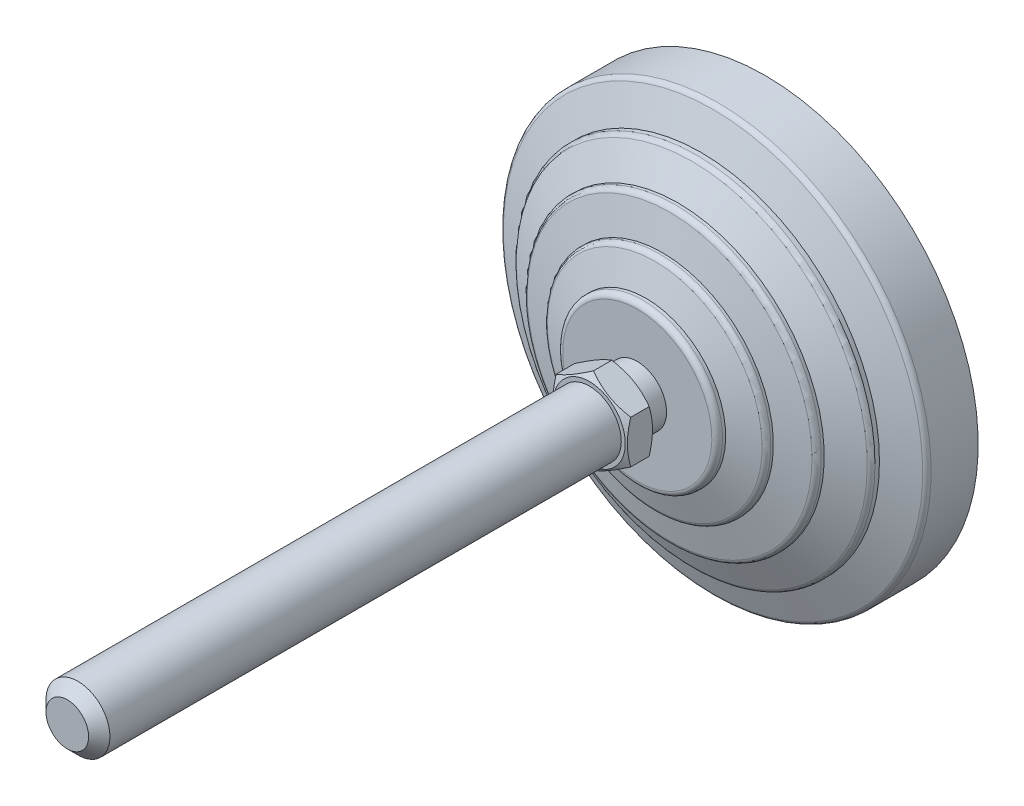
ISO-10303-21;
HEADER;
FILE_DESCRIPTION(('STEP AP214'),'2;1');
FILE_NAME('part.step','',(''),(''),'','','');
FILE_SCHEMA(('AUTOMOTIVE_DESIGN { 1 0 10303 214 1 1 1 1 }'));
ENDSEC;
DATA;
#1=APPLICATION_CONTEXT('core data for automotive mechanical design processes');
#2=APPLICATION_PROTOCOL_DEFINITION('international standard','automotive_design',2000,#1);
#3=PRODUCT_CONTEXT('',#1,'mechanical');
#4=PRODUCT('Part','Part','',(#3));
#5=PRODUCT_RELATED_PRODUCT_CATEGORY('part','',(#4));
#6=PRODUCT_DEFINITION_FORMATION('','',#4);
#7=PRODUCT_DEFINITION_CONTEXT('part definition',#1,'design');
#8=PRODUCT_DEFINITION('design','',#6,#7);
#9=PRODUCT_DEFINITION_SHAPE('','',#8);
#10=(LENGTH_UNIT() NAMED_UNIT(*) SI_UNIT(.MILLI.,.METRE.));
#11=(NAMED_UNIT(*) PLANE_ANGLE_UNIT() SI_UNIT($,.RADIAN.));
#12=(NAMED_UNIT(*) SI_UNIT($,.STERADIAN.) SOLID_ANGLE_UNIT());
#13=UNCERTAINTY_MEASURE_WITH_UNIT(LENGTH_MEASURE(1.E-05),#10,'distance_accuracy_value','');
#14=(GEOMETRIC_REPRESENTATION_CONTEXT(3) GLOBAL_UNCERTAINTY_ASSIGNED_CONTEXT((#13)) GLOBAL_UNIT_ASSIGNED_CONTEXT((#10,
#11,#12)) REPRESENTATION_CONTEXT('',''));
#15=CARTESIAN_POINT('',(0.,0.,0.));
#16=DIRECTION('',(0.,0.,1.));
#17=DIRECTION('',(1.,0.,0.));
#18=AXIS2_PLACEMENT_3D('',#15,#16,#17);
#19=CARTESIAN_POINT('',(-5.50000000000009,0.,31.));
#20=DIRECTION('',(0.,0.,1.));
#21=DIRECTION('',(0.,-1.,0.));
#22=AXIS2_PLACEMENT_3D('',#19,#20,#21);
#23=PLANE('',#22);
#24=CARTESIAN_POINT('',(0.,0.,30.9999999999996));
#25=DIRECTION('',(0.,0.,-1.));
#26=DIRECTION('',(-1.,0.,0.));
#27=AXIS2_PLACEMENT_3D('',#24,#25,#26);
#28=CIRCLE('',#27,6.75);
#29=CARTESIAN_POINT('',(-6.75,0.,30.9999999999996));
#30=VERTEX_POINT('',#29);
#31=EDGE_CURVE('E570',#30,#30,#28,.T.);
#32=ORIENTED_EDGE('',*,*,#31,.T.);
#33=EDGE_LOOP('',(#32));
#34=FACE_BOUND('',#33,.T.);
#35=CARTESIAN_POINT('',(0.,0.,31.));
#36=DIRECTION('',(0.,0.,-1.));
#37=DIRECTION('',(0.,1.,0.));
#38=AXIS2_PLACEMENT_3D('',#35,#36,#37);
#39=CIRCLE('',#38,5.50000000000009);
#40=CARTESIAN_POINT('',(0.,5.50000000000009,31.));
#41=VERTEX_POINT('',#40);
#42=EDGE_CURVE('E150',#41,#41,#39,.T.);
#43=ORIENTED_EDGE('',*,*,#42,.F.);
#44=EDGE_LOOP('',(#43));
#45=FACE_BOUND('',#44,.T.);
#46=ADVANCED_FACE('F14',(#34,#45),#23,.F.);
#47=CARTESIAN_POINT('',(0.,0.,0.));
#48=DIRECTION('',(0.,0.,-1.));
#49=DIRECTION('',(0.,1.,0.));
#50=AXIS2_PLACEMENT_3D('',#47,#48,#49);
#51=CYLINDRICAL_SURFACE('',#50,5.50000000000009);
#52=CARTESIAN_POINT('',(0.,0.,27.));
#53=DIRECTION('',(0.,0.,-1.));
#54=DIRECTION('',(0.,1.,0.));
#55=AXIS2_PLACEMENT_3D('',#52,#53,#54);
#56=CIRCLE('',#55,5.50000000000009);
#57=CARTESIAN_POINT('',(0.,5.50000000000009,27.));
#58=VERTEX_POINT('',#57);
#59=EDGE_CURVE('E147',#58,#58,#56,.T.);
#60=ORIENTED_EDGE('',*,*,#59,.F.);
#61=EDGE_LOOP('',(#60));
#62=FACE_BOUND('',#61,.T.);
#63=ORIENTED_EDGE('',*,*,#42,.T.);
#64=EDGE_LOOP('',(#63));
#65=FACE_BOUND('',#64,.T.);
#66=ADVANCED_FACE('F174',(#62,#65),#51,.T.);
#67=CARTESIAN_POINT('',(-5.50000000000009,0.,27.));
#68=DIRECTION('',(0.,0.,-1.));
#69=DIRECTION('',(0.,1.,0.));
#70=AXIS2_PLACEMENT_3D('',#67,#68,#69);
#71=PLANE('',#70);
#72=CARTESIAN_POINT('',(0.,0.,27.));
#73=DIRECTION('',(0.,0.,-1.));
#74=DIRECTION('',(0.,1.,0.));
#75=AXIS2_PLACEMENT_3D('',#72,#73,#74);
#76=CIRCLE('',#75,13.9999999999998);
#77=CARTESIAN_POINT('',(0.,13.9999999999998,27.));
#78=VERTEX_POINT('',#77);
#79=EDGE_CURVE('E144',#78,#78,#76,.T.);
#80=ORIENTED_EDGE('',*,*,#79,.F.);
#81=EDGE_LOOP('',(#80));
#82=FACE_BOUND('',#81,.T.);
#83=ORIENTED_EDGE('',*,*,#59,.T.);
#84=EDGE_LOOP('',(#83));
#85=FACE_BOUND('',#84,.T.);
#86=ADVANCED_FACE('F181',(#82,#85),#71,.F.);
#87=CARTESIAN_POINT('',(0.,0.,26.));
#88=DIRECTION('',(0.,0.,-1.));
#89=DIRECTION('',(0.,1.,0.));
#90=AXIS2_PLACEMENT_3D('',#87,#88,#89);
#91=TOROIDAL_SURFACE('',#90,13.9999999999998,1.);
#92=CARTESIAN_POINT('',(0.,0.,26.));
#93=DIRECTION('',(0.,0.,-1.));
#94=DIRECTION('',(0.,1.,0.));
#95=AXIS2_PLACEMENT_3D('',#92,#93,#94);
#96=CIRCLE('',#95,14.9999999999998);
#97=CARTESIAN_POINT('',(0.,14.9999999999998,26.));
#98=VERTEX_POINT('',#97);
#99=EDGE_CURVE('E141',#98,#98,#96,.T.);
#100=ORIENTED_EDGE('',*,*,#99,.F.);
#101=EDGE_LOOP('',(#100));
#102=FACE_BOUND('',#101,.T.);
#103=ORIENTED_EDGE('',*,*,#79,.T.);
#104=EDGE_LOOP('',(#103));
#105=FACE_BOUND('',#104,.T.);
#106=ADVANCED_FACE('F433',(#102,#105),#91,.T.);
#107=CARTESIAN_POINT('',(0.,0.,0.));
#108=DIRECTION('',(0.,0.,-1.));
#109=DIRECTION('',(0.,1.,0.));
#110=AXIS2_PLACEMENT_3D('',#107,#108,#109);
#111=CYLINDRICAL_SURFACE('',#110,14.9999999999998);
#112=CARTESIAN_POINT('',(0.,0.,25.4025287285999));
#113=DIRECTION('',(0.,0.,-1.));
#114=DIRECTION('',(0.,1.,0.));
#115=AXIS2_PLACEMENT_3D('',#112,#113,#114);
#116=CIRCLE('',#115,14.9999999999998);
#117=CARTESIAN_POINT('',(0.,14.9999999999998,25.4025287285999));
#118=VERTEX_POINT('',#117);
#119=EDGE_CURVE('E138',#118,#118,#116,.T.);
#120=ORIENTED_EDGE('',*,*,#119,.F.);
#121=EDGE_LOOP('',(#120));
#122=FACE_BOUND('',#121,.T.);
#123=ORIENTED_EDGE('',*,*,#99,.T.);
#124=EDGE_LOOP('',(#123));
#125=FACE_BOUND('',#124,.T.);
#126=ADVANCED_FACE('F423',(#122,#125),#111,.T.);
#127=CARTESIAN_POINT('',(0.,0.,25.4025287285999));
#128=DIRECTION('',(0.,0.,-1.));
#129=DIRECTION('',(0.,1.,0.));
#130=AXIS2_PLACEMENT_3D('',#127,#128,#129);
#131=CONICAL_SURFACE('',#130,14.9999999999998,1.25589726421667);
#132=CARTESIAN_POINT('',(0.,0.,23.7216684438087));
#133=DIRECTION('',(0.,0.,-1.));
#134=DIRECTION('',(0.,1.,0.));
#135=AXIS2_PLACEMENT_3D('',#132,#133,#134);
#136=CIRCLE('',#135,20.1601635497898);
#137=CARTESIAN_POINT('',(0.,20.1601635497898,23.7216684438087));
#138=VERTEX_POINT('',#137);
#139=EDGE_CURVE('E135',#138,#138,#136,.T.);
#140=ORIENTED_EDGE('',*,*,#139,.F.);
#141=EDGE_LOOP('',(#140));
#142=FACE_BOUND('',#141,.T.);
#143=ORIENTED_EDGE('',*,*,#119,.T.);
#144=EDGE_LOOP('',(#143));
#145=FACE_BOUND('',#144,.T.);
#146=ADVANCED_FACE('F413',(#142,#145),#131,.T.);
#147=CARTESIAN_POINT('',(0.,0.,22.7708407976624));
#148=DIRECTION('',(0.,0.,-1.));
#149=DIRECTION('',(0.,1.,0.));
#150=AXIS2_PLACEMENT_3D('',#147,#148,#149);
#151=TOROIDAL_SURFACE('',#150,19.8504430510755,1.);
#152=CARTESIAN_POINT('',(0.,0.,22.7708407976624));
#153=DIRECTION('',(0.,0.,-1.));
#154=DIRECTION('',(0.,1.,0.));
#155=AXIS2_PLACEMENT_3D('',#152,#153,#154);
#156=CIRCLE('',#155,20.8504430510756);
#157=CARTESIAN_POINT('',(0.,20.8504430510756,22.7708407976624));
#158=VERTEX_POINT('',#157);
#159=EDGE_CURVE('E132',#158,#158,#156,.T.);
#160=ORIENTED_EDGE('',*,*,#159,.F.);
#161=EDGE_LOOP('',(#160));
#162=FACE_BOUND('',#161,.T.);
#163=ORIENTED_EDGE('',*,*,#139,.T.);
#164=EDGE_LOOP('',(#163));
#165=FACE_BOUND('',#164,.T.);
#166=ADVANCED_FACE('F403',(#162,#165),#151,.T.);
#167=CARTESIAN_POINT('',(0.,0.,0.));
#168=DIRECTION('',(0.,0.,-1.));
#169=DIRECTION('',(0.,1.,0.));
#170=AXIS2_PLACEMENT_3D('',#167,#168,#169);
#171=CYLINDRICAL_SURFACE('',#170,20.8504430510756);
#172=CARTESIAN_POINT('',(0.,0.,22.2987385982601));
#173=DIRECTION('',(0.,0.,-1.));
#174=DIRECTION('',(0.,1.,0.));
#175=AXIS2_PLACEMENT_3D('',#172,#173,#174);
#176=CIRCLE('',#175,20.8504430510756);
#177=CARTESIAN_POINT('',(0.,20.8504430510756,22.2987385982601));
#178=VERTEX_POINT('',#177);
#179=EDGE_CURVE('E129',#178,#178,#176,.T.);
#180=ORIENTED_EDGE('',*,*,#179,.F.);
#181=EDGE_LOOP('',(#180));
#182=FACE_BOUND('',#181,.T.);
#183=ORIENTED_EDGE('',*,*,#159,.T.);
#184=EDGE_LOOP('',(#183));
#185=FACE_BOUND('',#184,.T.);
#186=ADVANCED_FACE('F393',(#182,#185),#171,.T.);
#187=CARTESIAN_POINT('',(0.,0.,22.2987385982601));
#188=DIRECTION('',(0.,0.,-1.));
#189=DIRECTION('',(0.,1.,0.));
#190=AXIS2_PLACEMENT_3D('',#187,#188,#189);
#191=CONICAL_SURFACE('',#190,20.8504430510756,1.34067144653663);
#192=CARTESIAN_POINT('',(0.,0.,20.9217501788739));
#193=DIRECTION('',(0.,0.,-1.));
#194=DIRECTION('',(0.,1.,0.));
#195=AXIS2_PLACEMENT_3D('',#192,#193,#194);
#196=CIRCLE('',#195,26.728099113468);
#197=CARTESIAN_POINT('',(0.,26.728099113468,20.9217501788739));
#198=VERTEX_POINT('',#197);
#199=EDGE_CURVE('E126',#198,#198,#196,.T.);
#200=ORIENTED_EDGE('',*,*,#199,.F.);
#201=EDGE_LOOP('',(#200));
#202=FACE_BOUND('',#201,.T.);
#203=ORIENTED_EDGE('',*,*,#179,.T.);
#204=EDGE_LOOP('',(#203));
#205=FACE_BOUND('',#204,.T.);
#206=ADVANCED_FACE('F383',(#202,#205),#191,.T.);
#207=CARTESIAN_POINT('',(0.,0.,19.9481122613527));
#208=DIRECTION('',(0.,0.,-1.));
#209=DIRECTION('',(0.,1.,0.));
#210=AXIS2_PLACEMENT_3D('',#207,#208,#209);
#211=TOROIDAL_SURFACE('',#210,26.5,1.00000000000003);
#212=CARTESIAN_POINT('',(0.,0.,19.9481122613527));
#213=DIRECTION('',(0.,0.,-1.));
#214=DIRECTION('',(0.,1.,0.));
#215=AXIS2_PLACEMENT_3D('',#212,#213,#214);
#216=CIRCLE('',#215,27.5);
#217=CARTESIAN_POINT('',(0.,27.5,19.9481122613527));
#218=VERTEX_POINT('',#217);
#219=EDGE_CURVE('E123',#218,#218,#216,.T.);
#220=ORIENTED_EDGE('',*,*,#219,.F.);
#221=EDGE_LOOP('',(#220));
#222=FACE_BOUND('',#221,.T.);
#223=ORIENTED_EDGE('',*,*,#199,.T.);
#224=EDGE_LOOP('',(#223));
#225=FACE_BOUND('',#224,.T.);
#226=ADVANCED_FACE('F373',(#222,#225),#211,.T.);
#227=CARTESIAN_POINT('',(0.,0.,0.));
#228=DIRECTION('',(0.,0.,-1.));
#229=DIRECTION('',(0.,1.,0.));
#230=AXIS2_PLACEMENT_3D('',#227,#228,#229);
#231=CYLINDRICAL_SURFACE('',#230,27.5);
#232=CARTESIAN_POINT('',(0.,0.,19.4025287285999));
#233=DIRECTION('',(0.,0.,-1.));
#234=DIRECTION('',(0.,1.,0.));
#235=AXIS2_PLACEMENT_3D('',#232,#233,#234);
#236=CIRCLE('',#235,27.5);
#237=CARTESIAN_POINT('',(0.,27.5,19.4025287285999));
#238=VERTEX_POINT('',#237);
#239=EDGE_CURVE('E120',#238,#238,#236,.T.);
#240=ORIENTED_EDGE('',*,*,#239,.F.);
#241=EDGE_LOOP('',(#240));
#242=FACE_BOUND('',#241,.T.);
#243=ORIENTED_EDGE('',*,*,#219,.T.);
#244=EDGE_LOOP('',(#243));
#245=FACE_BOUND('',#244,.T.);
#246=ADVANCED_FACE('F363',(#242,#245),#231,.T.);
#247=CARTESIAN_POINT('',(0.,0.,19.4025287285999));
#248=DIRECTION('',(0.,0.,-1.));
#249=DIRECTION('',(0.,1.,0.));
#250=AXIS2_PLACEMENT_3D('',#247,#248,#249);
#251=CONICAL_SURFACE('',#250,27.5,1.1202291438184);
#252=CARTESIAN_POINT('',(0.,0.,16.7730910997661));
#253=DIRECTION('',(0.,0.,-1.));
#254=DIRECTION('',(0.,1.,0.));
#255=AXIS2_PLACEMENT_3D('',#252,#253,#254);
#256=CIRCLE('',#255,32.935476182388);
#257=CARTESIAN_POINT('',(0.,32.935476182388,16.7730910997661));
#258=VERTEX_POINT('',#257);
#259=EDGE_CURVE('E117',#258,#258,#256,.T.);
#260=ORIENTED_EDGE('',*,*,#259,.F.);
#261=EDGE_LOOP('',(#260));
#262=FACE_BOUND('',#261,.T.);
#263=ORIENTED_EDGE('',*,*,#239,.T.);
#264=EDGE_LOOP('',(#263));
#265=FACE_BOUND('',#264,.T.);
#266=ADVANCED_FACE('F353',(#262,#265),#251,.T.);
#267=CARTESIAN_POINT('',(0.,0.,15.8728908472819));
#268=DIRECTION('',(0.,0.,-1.));
#269=DIRECTION('',(0.,1.,0.));
#270=AXIS2_PLACEMENT_3D('',#267,#268,#269);
#271=TOROIDAL_SURFACE('',#270,32.5,0.999999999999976);
#272=CARTESIAN_POINT('',(0.,0.,15.8728908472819));
#273=DIRECTION('',(0.,0.,-1.));
#274=DIRECTION('',(0.,1.,0.));
#275=AXIS2_PLACEMENT_3D('',#272,#273,#274);
#276=CIRCLE('',#275,33.5);
#277=CARTESIAN_POINT('',(0.,33.5,15.8728908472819));
#278=VERTEX_POINT('',#277);
#279=EDGE_CURVE('E114',#278,#278,#276,.T.);
#280=ORIENTED_EDGE('',*,*,#279,.F.);
#281=EDGE_LOOP('',(#280));
#282=FACE_BOUND('',#281,.T.);
#283=ORIENTED_EDGE('',*,*,#259,.T.);
#284=EDGE_LOOP('',(#283));
#285=FACE_BOUND('',#284,.T.);
#286=ADVANCED_FACE('F343',(#282,#285),#271,.T.);
#287=CARTESIAN_POINT('',(0.,0.,0.));
#288=DIRECTION('',(0.,0.,-1.));
#289=DIRECTION('',(0.,1.,0.));
#290=AXIS2_PLACEMENT_3D('',#287,#288,#289);
#291=CYLINDRICAL_SURFACE('',#290,33.5);
#292=CARTESIAN_POINT('',(0.,0.,15.0315037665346));
#293=DIRECTION('',(0.,0.,-1.));
#294=DIRECTION('',(0.,1.,0.));
#295=AXIS2_PLACEMENT_3D('',#292,#293,#294);
#296=CIRCLE('',#295,33.5);
#297=CARTESIAN_POINT('',(0.,33.5,15.0315037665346));
#298=VERTEX_POINT('',#297);
#299=EDGE_CURVE('E111',#298,#298,#296,.T.);
#300=ORIENTED_EDGE('',*,*,#299,.F.);
#301=EDGE_LOOP('',(#300));
#302=FACE_BOUND('',#301,.T.);
#303=ORIENTED_EDGE('',*,*,#279,.T.);
#304=EDGE_LOOP('',(#303));
#305=FACE_BOUND('',#304,.T.);
#306=ADVANCED_FACE('F333',(#302,#305),#291,.T.);
#307=CARTESIAN_POINT('',(0.,0.,15.0315037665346));
#308=DIRECTION('',(0.,0.,-1.));
#309=DIRECTION('',(0.,1.,0.));
#310=AXIS2_PLACEMENT_3D('',#307,#308,#309);
#311=CONICAL_SURFACE('',#310,33.5,1.20362249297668);
#312=CARTESIAN_POINT('',(0.,0.,12.7780502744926));
#313=DIRECTION('',(0.,0.,-1.));
#314=DIRECTION('',(0.,1.,0.));
#315=AXIS2_PLACEMENT_3D('',#312,#313,#314);
#316=CIRCLE('',#315,39.3589790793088);
#317=CARTESIAN_POINT('',(0.,39.3589790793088,12.7780502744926));
#318=VERTEX_POINT('',#317);
#319=EDGE_CURVE('E108',#318,#318,#316,.T.);
#320=ORIENTED_EDGE('',*,*,#319,.F.);
#321=EDGE_LOOP('',(#320));
#322=FACE_BOUND('',#321,.T.);
#323=ORIENTED_EDGE('',*,*,#299,.T.);
#324=EDGE_LOOP('',(#323));
#325=FACE_BOUND('',#324,.T.);
#326=ADVANCED_FACE('F323',(#322,#325),#311,.T.);
#327=CARTESIAN_POINT('',(0.,0.,11.8447046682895));
#328=DIRECTION('',(0.,0.,-1.));
#329=DIRECTION('',(0.,1.,0.));
#330=AXIS2_PLACEMENT_3D('',#327,#328,#329);
#331=TOROIDAL_SURFACE('',#330,39.,1.00000000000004);
#332=CARTESIAN_POINT('',(0.,0.,11.8447046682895));
#333=DIRECTION('',(0.,0.,-1.));
#334=DIRECTION('',(0.,1.,0.));
#335=AXIS2_PLACEMENT_3D('',#332,#333,#334);
#336=CIRCLE('',#335,40.);
#337=CARTESIAN_POINT('',(0.,40.,11.8447046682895));
#338=VERTEX_POINT('',#337);
#339=EDGE_CURVE('E105',#338,#338,#336,.T.);
#340=ORIENTED_EDGE('',*,*,#339,.F.);
#341=EDGE_LOOP('',(#340));
#342=FACE_BOUND('',#341,.T.);
#343=ORIENTED_EDGE('',*,*,#319,.T.);
#344=EDGE_LOOP('',(#343));
#345=FACE_BOUND('',#344,.T.);
#346=ADVANCED_FACE('F313',(#342,#345),#331,.T.);
#347=CARTESIAN_POINT('',(0.,0.,0.));
#348=DIRECTION('',(0.,0.,-1.));
#349=DIRECTION('',(0.,1.,0.));
#350=AXIS2_PLACEMENT_3D('',#347,#348,#349);
#351=CYLINDRICAL_SURFACE('',#350,40.);
#352=CARTESIAN_POINT('',(0.,0.,3.));
#353=DIRECTION('',(0.,0.,-1.));
#354=DIRECTION('',(0.,1.,0.));
#355=AXIS2_PLACEMENT_3D('',#352,#353,#354);
#356=CIRCLE('',#355,40.);
#357=CARTESIAN_POINT('',(0.,40.,3.));
#358=VERTEX_POINT('',#357);
#359=EDGE_CURVE('E102',#358,#358,#356,.T.);
#360=ORIENTED_EDGE('',*,*,#359,.F.);
#361=EDGE_LOOP('',(#360));
#362=FACE_BOUND('',#361,.T.);
#363=ORIENTED_EDGE('',*,*,#339,.T.);
#364=EDGE_LOOP('',(#363));
#365=FACE_BOUND('',#364,.T.);
#366=ADVANCED_FACE('F303',(#362,#365),#351,.T.);
#367=CARTESIAN_POINT('',(-33.5,0.,3.));
#368=DIRECTION('',(0.,0.,1.));
#369=DIRECTION('',(0.,-1.,0.));
#370=AXIS2_PLACEMENT_3D('',#367,#368,#369);
#371=PLANE('',#370);
#372=CARTESIAN_POINT('',(0.,0.,3.));
#373=DIRECTION('',(0.,0.,-1.));
#374=DIRECTION('',(0.,1.,0.));
#375=AXIS2_PLACEMENT_3D('',#372,#373,#374);
#376=CIRCLE('',#375,33.5);
#377=CARTESIAN_POINT('',(0.,33.5,3.));
#378=VERTEX_POINT('',#377);
#379=EDGE_CURVE('E99',#378,#378,#376,.T.);
#380=ORIENTED_EDGE('',*,*,#379,.F.);
#381=EDGE_LOOP('',(#380));
#382=FACE_BOUND('',#381,.T.);
#383=ORIENTED_EDGE('',*,*,#359,.T.);
#384=EDGE_LOOP('',(#383));
#385=FACE_BOUND('',#384,.T.);
#386=ADVANCED_FACE('F293',(#382,#385),#371,.F.);
#387=CARTESIAN_POINT('',(0.,0.,0.));
#388=DIRECTION('',(0.,0.,-1.));
#389=DIRECTION('',(0.,1.,0.));
#390=AXIS2_PLACEMENT_3D('',#387,#388,#389);
#391=CYLINDRICAL_SURFACE('',#390,33.5);
#392=CARTESIAN_POINT('',(0.,0.,0.));
#393=DIRECTION('',(0.,0.,-1.));
#394=DIRECTION('',(0.,1.,0.));
#395=AXIS2_PLACEMENT_3D('',#392,#393,#394);
#396=CIRCLE('',#395,33.5);
#397=CARTESIAN_POINT('',(0.,33.5,0.));
#398=VERTEX_POINT('',#397);
#399=EDGE_CURVE('E96',#398,#398,#396,.T.);
#400=ORIENTED_EDGE('',*,*,#399,.F.);
#401=EDGE_LOOP('',(#400));
#402=FACE_BOUND('',#401,.T.);
#403=ORIENTED_EDGE('',*,*,#379,.T.);
#404=EDGE_LOOP('',(#403));
#405=FACE_BOUND('',#404,.T.);
#406=ADVANCED_FACE('F282',(#402,#405),#391,.T.);
#407=CARTESIAN_POINT('',(0.,0.,0.));
#408=DIRECTION('',(0.,0.,1.));
#409=DIRECTION('',(0.,-1.,0.));
#410=AXIS2_PLACEMENT_3D('',#407,#408,#409);
#411=PLANE('',#410);
#412=ORIENTED_EDGE('',*,*,#399,.T.);
#413=EDGE_LOOP('',(#412));
#414=FACE_BOUND('',#413,.T.);
#415=ADVANCED_FACE('F172',(#414),#411,.F.);
#416=CARTESIAN_POINT('',(0.,0.,32.5570935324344));
#417=DIRECTION('',(0.,0.,1.));
#418=DIRECTION('',(1.,0.,0.));
#419=AXIS2_PLACEMENT_3D('',#416,#417,#418);
#420=CONICAL_SURFACE('',#419,9.44696511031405,1.0471975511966);
#421=CARTESIAN_POINT('',(0.25600301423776,-8.23070717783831,31.8571847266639));
#422=CARTESIAN_POINT('',(-0.070615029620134,-8.04213416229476,31.7424889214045));
#423=CARTESIAN_POINT('',(-0.400287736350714,-7.85179753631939,31.6375188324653));
#424=CARTESIAN_POINT('',(-1.06601038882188,-7.46744238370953,31.4532425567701));
#425=CARTESIAN_POINT('',(-1.40207718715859,-7.27341412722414,31.3740184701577));
#426=CARTESIAN_POINT('',(-1.90475808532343,-6.98319117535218,31.2805960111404));
#427=CARTESIAN_POINT('',(-2.0696253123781,-6.88800503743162,31.2539105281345));
#428=CARTESIAN_POINT('',(-2.40022225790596,-6.69713480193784,31.2088893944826));
#429=CARTESIAN_POINT('',(-2.5659519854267,-6.60145069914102,31.1905538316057));
#430=CARTESIAN_POINT('',(-2.89770419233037,-6.40991347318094,31.1627557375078));
#431=CARTESIAN_POINT('',(-3.06372576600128,-6.31406087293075,31.1532789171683));
#432=CARTESIAN_POINT('',(-3.39597239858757,-6.12223819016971,31.1434181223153));
#433=CARTESIAN_POINT('',(-3.56219745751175,-6.02626810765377,31.1430341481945));
#434=CARTESIAN_POINT('',(-3.90488807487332,-5.82841558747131,31.1516338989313));
#435=CARTESIAN_POINT('',(-4.08134266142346,-5.72653948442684,31.161206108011));
#436=CARTESIAN_POINT('',(-4.43363202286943,-5.52314512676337,31.1903248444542));
#437=CARTESIAN_POINT('',(-4.60946677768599,-5.42162688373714,31.209871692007));
#438=CARTESIAN_POINT('',(-4.96048530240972,-5.21896624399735,31.2583893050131));
#439=CARTESIAN_POINT('',(-5.13566722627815,-5.11782491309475,31.2873777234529));
#440=CARTESIAN_POINT('',(-5.48480072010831,-4.91625259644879,31.3539740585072));
#441=CARTESIAN_POINT('',(-5.65875219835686,-4.81582166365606,31.3915826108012));
#442=CARTESIAN_POINT('',(-6.01079289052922,-4.61257087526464,31.4758443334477));
#443=CARTESIAN_POINT('',(-6.18883684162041,-4.50977715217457,31.5227479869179));
#444=CARTESIAN_POINT('',(-6.54339145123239,-4.30507495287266,31.6237775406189));
#445=CARTESIAN_POINT('',(-6.71990194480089,-4.2031665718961,31.6779042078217));
#446=CARTESIAN_POINT('',(-7.0706560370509,-4.00065860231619,31.7921756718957));
#447=CARTESIAN_POINT('',(-7.24490599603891,-3.90005534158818,31.8522946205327));
#448=CARTESIAN_POINT('',(-7.59188733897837,-3.69972556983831,31.9778746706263));
#449=CARTESIAN_POINT('',(-7.76461927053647,-3.5999987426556,32.043333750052));
#450=CARTESIAN_POINT('',(-7.93666176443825,-3.50066996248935,32.1110553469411));
#451=B_SPLINE_CURVE_WITH_KNOTS('',3,(#421,#422,#423,#424,#425,#426,#427,#428,#429,#430,#431,
#432,#433,#434,#435,#436,#437,#438,#439,#440,#441,#442,#443,#444,#445,#446,#447,#448,#449,#450),
.UNSPECIFIED.,.F.,.F.,(4,2,2,2,2,2,2,2,2,2,2,2,2,2,4),(0.,1.18334682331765,2.37043095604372,
2.94696256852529,3.52350024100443,4.09910634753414,4.6747124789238,5.28638588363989,
5.89807892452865,6.51092228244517,7.1238108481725,7.7562718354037,8.38880003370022,
9.0187090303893,9.648380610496),.UNSPECIFIED.);
#452=CARTESIAN_POINT('',(0.,-8.08290376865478,31.7695523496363));
#453=VERTEX_POINT('',#452);
#454=CARTESIAN_POINT('',(-7.,-4.0414518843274,31.7695523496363));
#455=VERTEX_POINT('',#454);
#456=EDGE_CURVE('E73',#453,#455,#451,.T.);
#457=ORIENTED_EDGE('',*,*,#456,.T.);
#458=CARTESIAN_POINT('',(-7.,-10.8079970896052,34.5373280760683));
#459=CARTESIAN_POINT('',(-7.,-10.5026576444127,34.3894040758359));
#460=CARTESIAN_POINT('',(-7.,-10.1966121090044,34.2429123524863));
#461=CARTESIAN_POINT('',(-7.,-9.58273315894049,33.9535999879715));
#462=CARTESIAN_POINT('',(-7.,-9.27489946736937,33.810779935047));
#463=CARTESIAN_POINT('',(-7.,-8.65545939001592,33.5288886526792));
#464=CARTESIAN_POINT('',(-7.,-8.34384155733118,33.3898424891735));
#465=CARTESIAN_POINT('',(-7.,-7.71811061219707,33.1175047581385));
#466=CARTESIAN_POINT('',(-7.,-7.40399761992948,32.9842129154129));
#467=CARTESIAN_POINT('',(-7.,-6.76282659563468,32.7208172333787));
#468=CARTESIAN_POINT('',(-7.,-6.43567245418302,32.5909460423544));
#469=CARTESIAN_POINT('',(-7.,-5.7775198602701,32.3411491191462));
#470=CARTESIAN_POINT('',(-7.,-5.44652097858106,32.2212245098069));
#471=CARTESIAN_POINT('',(-7.,-4.78078344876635,31.9945044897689));
#472=CARTESIAN_POINT('',(-7.,-4.44605409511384,31.8876820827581));
#473=CARTESIAN_POINT('',(-7.,-3.77180650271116,31.6906242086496));
#474=CARTESIAN_POINT('',(-7.,-3.43228982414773,31.6003834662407));
#475=CARTESIAN_POINT('',(-7.,-2.75009172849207,31.4413341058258));
#476=CARTESIAN_POINT('',(-7.,-2.4074377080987,31.372411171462));
#477=CARTESIAN_POINT('',(-7.,-1.89037501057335,31.288023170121));
#478=CARTESIAN_POINT('',(-7.,-1.71749410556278,31.2630587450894));
#479=CARTESIAN_POINT('',(-7.,-1.37088935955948,31.2199527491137));
#480=CARTESIAN_POINT('',(-7.,-1.19716560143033,31.2018105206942));
#481=CARTESIAN_POINT('',(-7.,-0.851356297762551,31.172935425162));
#482=CARTESIAN_POINT('',(-7.,-0.679278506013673,31.1621100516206));
#483=CARTESIAN_POINT('',(-7.,-0.33481955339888,31.1477424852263));
#484=CARTESIAN_POINT('',(-7.,-0.162438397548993,31.144200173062));
#485=CARTESIAN_POINT('',(-7.,0.18231972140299,31.1444831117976));
#486=CARTESIAN_POINT('',(-7.,0.354696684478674,31.1483084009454));
#487=CARTESIAN_POINT('',(-7.,0.699137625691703,31.1632338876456));
#488=CARTESIAN_POINT('',(-7.,0.871201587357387,31.1743344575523));
#489=CARTESIAN_POINT('',(-7.,1.28618460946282,31.2096469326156));
#490=CARTESIAN_POINT('',(-7.,1.52880922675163,31.2373917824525));
#491=CARTESIAN_POINT('',(-7.,2.01221470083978,31.3058222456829));
#492=CARTESIAN_POINT('',(-7.,2.25299529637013,31.3465096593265));
#493=CARTESIAN_POINT('',(-7.,2.97231989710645,31.485824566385));
#494=CARTESIAN_POINT('',(-7.,3.44756940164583,31.6016780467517));
#495=CARTESIAN_POINT('',(-7.,4.15813280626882,31.8020368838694));
#496=CARTESIAN_POINT('',(-7.,4.39714588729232,31.8741731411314));
#497=CARTESIAN_POINT('',(-7.,4.87284966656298,32.0258029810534));
#498=CARTESIAN_POINT('',(-7.,5.10954034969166,32.1052966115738));
#499=CARTESIAN_POINT('',(-7.,5.58067642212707,32.2703769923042));
#500=CARTESIAN_POINT('',(-7.,5.81512255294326,32.3559616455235));
#501=CARTESIAN_POINT('',(-7.,6.28208147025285,32.5322305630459));
#502=CARTESIAN_POINT('',(-7.,6.51459427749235,32.6229147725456));
#503=CARTESIAN_POINT('',(-7.,7.05547355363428,32.8396114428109));
#504=CARTESIAN_POINT('',(-7.,7.36317253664,32.9672866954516));
#505=CARTESIAN_POINT('',(-7.,7.97602160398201,33.2286316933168));
#506=CARTESIAN_POINT('',(-7.,8.28117154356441,33.3623017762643));
#507=CARTESIAN_POINT('',(-7.,8.88938115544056,33.6344544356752));
#508=CARTESIAN_POINT('',(-7.,9.19244042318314,33.7729379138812));
#509=CARTESIAN_POINT('',(-7.,9.79676493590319,34.0537722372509));
#510=CARTESIAN_POINT('',(-7.,10.0980301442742,34.1961231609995));
#511=CARTESIAN_POINT('',(-7.,10.6993542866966,34.4841222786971));
#512=CARTESIAN_POINT('',(-7.,10.999411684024,34.6297736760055));
#513=CARTESIAN_POINT('',(-7.,11.5982487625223,34.9236821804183));
#514=CARTESIAN_POINT('',(-7.,11.8970284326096,35.0719393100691));
#515=CARTESIAN_POINT('',(-7.,12.7916766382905,35.5199003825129));
#516=CARTESIAN_POINT('',(-7.,13.3859297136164,35.8228303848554));
#517=CARTESIAN_POINT('',(-7.,14.5228861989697,36.409786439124));
#518=CARTESIAN_POINT('',(-7.,15.0658365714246,36.6933362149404));
#519=CARTESIAN_POINT('',(-7.,16.1497137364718,37.2643176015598));
#520=CARTESIAN_POINT('',(-7.,16.6906404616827,37.5517493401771));
#521=CARTESIAN_POINT('',(-7.,17.7696231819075,38.1288892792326));
#522=CARTESIAN_POINT('',(-7.,18.3076829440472,38.4185904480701));
#523=CARTESIAN_POINT('',(-7.,19.3825040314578,39.0003251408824));
#524=CARTESIAN_POINT('',(-7.,19.919265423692,39.2923585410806));
#525=CARTESIAN_POINT('',(-7.,20.4555466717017,39.5852651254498));
#526=B_SPLINE_CURVE_WITH_KNOTS('',3,(#458,#459,#460,#461,#462,#463,#464,#465,#466,#467,#468,
#469,#470,#471,#472,#473,#474,#475,#476,#477,#478,#479,#480,#481,#482,#483,#484,#485,#486,#487,
#488,#489,#490,#491,#492,#493,#494,#495,#496,#497,#498,#499,#500,#501,#502,#503,#504,#505,#506,
#507,#508,#509,#510,#511,#512,#513,#514,#515,#516,#517,#518,#519,#520,#521,#522,#523,#524,#525),
.UNSPECIFIED.,.F.,.F.,(4,2,2,2,2,2,2,2,2,2,2,2,2,2,2,2,2,2,2,2,2,2,2,2,2,2,2,2,2,2,2,2,2,4),(0.,
1.01786490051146,2.03589187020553,3.05954229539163,4.08314371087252,5.13898568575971,
6.19494669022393,7.24869403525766,8.30210555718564,9.34976611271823,9.8736748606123,
10.3975331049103,10.9146377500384,11.4317339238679,11.9488327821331,12.4659581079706,
13.1981608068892,13.9304653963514,15.395906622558,16.144830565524,16.8937593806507,
17.6424315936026,18.391095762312,19.390419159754,20.389798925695,21.3893669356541,
22.3889552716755,23.3895592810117,24.3901719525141,26.391146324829,28.2287258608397,
30.0663660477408,31.8996399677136,33.7328172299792),.UNSPECIFIED.);
#527=CARTESIAN_POINT('',(-7.,4.04145188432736,31.7695523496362));
#528=VERTEX_POINT('',#527);
#529=EDGE_CURVE('E81',#455,#528,#526,.T.);
#530=ORIENTED_EDGE('',*,*,#529,.T.);
#531=CARTESIAN_POINT('',(-12.6959013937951,0.752921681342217,34.4457462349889));
#532=CARTESIAN_POINT('',(-12.4269936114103,0.908175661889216,34.2961172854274));
#533=CARTESIAN_POINT('',(-12.1574322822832,1.0638069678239,34.1480244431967));
#534=CARTESIAN_POINT('',(-11.616641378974,1.37603274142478,33.855807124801));
#535=CARTESIAN_POINT('',(-11.345411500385,1.53262738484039,33.7116834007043));
#536=CARTESIAN_POINT('',(-10.7993041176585,1.84792262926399,33.4274627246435));
#537=CARTESIAN_POINT('',(-10.5244143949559,2.00663028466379,33.2873969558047));
#538=CARTESIAN_POINT('',(-9.97229732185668,2.3253952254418,33.0135750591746));
#539=CARTESIAN_POINT('',(-9.69507010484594,2.48545243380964,32.8798185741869));
#540=CARTESIAN_POINT('',(-9.13521550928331,2.80868463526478,32.6191297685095));
#541=CARTESIAN_POINT('',(-8.85256189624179,2.97187477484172,32.4922721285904));
#542=CARTESIAN_POINT('',(-8.28381716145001,3.30023970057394,32.249072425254));
#543=CARTESIAN_POINT('',(-7.99772563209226,3.4654147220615,32.1327316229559));
#544=CARTESIAN_POINT('',(-7.42230980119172,3.7976312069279,31.9139294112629));
#545=CARTESIAN_POINT('',(-7.13299496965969,3.96466720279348,31.8114351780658));
#546=CARTESIAN_POINT('',(-6.55021067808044,4.30113787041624,31.6238838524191));
#547=CARTESIAN_POINT('',(-6.25674269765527,4.47057168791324,31.5388207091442));
#548=CARTESIAN_POINT('',(-5.67027025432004,4.80917171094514,31.3917666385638));
#549=CARTESIAN_POINT('',(-5.37733258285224,4.97829935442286,31.3294304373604));
#550=CARTESIAN_POINT('',(-4.93551941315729,5.23338030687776,31.2550123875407));
#551=CARTESIAN_POINT('',(-4.78782774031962,5.31865013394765,31.2333858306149));
#552=CARTESIAN_POINT('',(-4.49182163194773,5.48954934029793,31.1969233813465));
#553=CARTESIAN_POINT('',(-4.34350725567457,5.57517868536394,31.1820868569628));
#554=CARTESIAN_POINT('',(-4.04730295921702,5.74619231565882,31.1595953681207));
#555=CARTESIAN_POINT('',(-3.89941530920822,5.83157529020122,31.1519006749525));
#556=CARTESIAN_POINT('',(-3.60349140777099,6.00242703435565,31.1437248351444));
#557=CARTESIAN_POINT('',(-3.45545515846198,6.08789580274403,31.1432435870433));
#558=CARTESIAN_POINT('',(-3.15953454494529,6.25874564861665,31.1495058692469));
#559=CARTESIAN_POINT('',(-3.01165015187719,6.34412674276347,31.1562475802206));
#560=CARTESIAN_POINT('',(-2.71624764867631,6.51467745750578,31.176795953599));
#561=CARTESIAN_POINT('',(-2.56872956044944,6.59984706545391,31.190603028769));
#562=CARTESIAN_POINT('',(-2.20482587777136,6.80994695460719,31.2331001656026));
#563=CARTESIAN_POINT('',(-1.98877995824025,6.9346811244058,31.2657384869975));
#564=CARTESIAN_POINT('',(-1.55851476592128,7.18309484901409,31.344295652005));
#565=CARTESIAN_POINT('',(-1.34429579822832,7.30677422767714,31.3902166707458));
#566=CARTESIAN_POINT('',(-0.703938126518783,7.67648490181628,31.545581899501));
#567=CARTESIAN_POINT('',(-0.280952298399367,7.92069588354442,31.6725163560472));
#568=CARTESIAN_POINT('',(0.351418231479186,8.28579517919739,31.8894327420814));
#569=CARTESIAN_POINT('',(0.56414463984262,8.40861282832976,31.9671472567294));
#570=CARTESIAN_POINT('',(0.987543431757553,8.65306223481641,32.1298406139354));
#571=CARTESIAN_POINT('',(1.19821563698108,8.77469388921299,32.2148200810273));
#572=CARTESIAN_POINT('',(1.61644927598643,9.01616119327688,32.390259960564));
#573=CARTESIAN_POINT('',(1.82402163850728,9.13600315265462,32.4806859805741));
#574=CARTESIAN_POINT('',(2.23743181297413,9.37468562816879,32.666459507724));
#575=CARTESIAN_POINT('',(2.44327017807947,9.49352646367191,32.7618053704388));
#576=CARTESIAN_POINT('',(2.64838351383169,9.61194870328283,32.8591429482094));
#577=B_SPLINE_CURVE_WITH_KNOTS('',3,(#531,#532,#533,#534,#535,#536,#537,#538,#539,#540,#541,
#542,#543,#544,#545,#546,#547,#548,#549,#550,#551,#552,#553,#554,#555,#556,#557,#558,#559,#560,
#561,#562,#563,#564,#565,#566,#567,#568,#569,#570,#571,#572,#573,#574,#575,#576),.UNSPECIFIED.,
.F.,.F.,(4,2,2,2,2,2,2,2,2,2,2,2,2,2,2,2,2,2,2,2,2,2,4),(0.,1.03405394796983,2.06830249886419,
3.10908348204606,4.14980547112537,5.20016675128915,6.25065381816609,7.29860525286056,
8.34619229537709,9.37712627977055,9.89272838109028,10.4082824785,10.9209511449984,
11.4336126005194,11.946144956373,12.4587072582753,13.2130566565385,13.9675296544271,
15.4794387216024,16.2522929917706,17.0252137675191,17.7936821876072,18.5618953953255),.UNSPECIFIED.);
#578=CARTESIAN_POINT('',(0.,8.08290376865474,31.7695523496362));
#579=VERTEX_POINT('',#578);
#580=EDGE_CURVE('E525',#528,#579,#577,.T.);
#581=ORIENTED_EDGE('',*,*,#580,.T.);
#582=CARTESIAN_POINT('',(-0.943608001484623,8.62769610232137,32.1137916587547));
#583=CARTESIAN_POINT('',(-0.771466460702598,8.52831013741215,32.0459620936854));
#584=CARTESIAN_POINT('',(-0.598635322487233,8.42852603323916,31.9803933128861));
#585=CARTESIAN_POINT('',(-0.251454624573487,8.22808116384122,31.8545908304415));
#586=CARTESIAN_POINT('',(-0.0771045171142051,8.12742008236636,31.7943591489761));
#587=CARTESIAN_POINT('',(0.273853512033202,7.92479436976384,31.6798586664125));
#588=CARTESIAN_POINT('',(0.450467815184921,7.82282605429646,31.6256157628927));
#589=CARTESIAN_POINT('',(0.80523243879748,7.6180026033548,31.5243524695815));
#590=CARTESIAN_POINT('',(0.983382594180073,7.51514756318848,31.4773313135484));
#591=CARTESIAN_POINT('',(1.33563223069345,7.31177614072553,31.3928396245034));
#592=CARTESIAN_POINT('',(1.50968632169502,7.21128596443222,31.3551184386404));
#593=CARTESIAN_POINT('',(1.85902879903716,7.00959299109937,31.2882995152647));
#594=CARTESIAN_POINT('',(2.03431709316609,6.90839024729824,31.259201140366));
#595=CARTESIAN_POINT('',(2.3855520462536,6.70560465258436,31.2104696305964));
#596=CARTESIAN_POINT('',(2.56149684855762,6.60402287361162,31.1908188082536));
#597=CARTESIAN_POINT('',(2.91401070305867,6.40049890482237,31.161501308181));
#598=CARTESIAN_POINT('',(3.09057973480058,6.29855672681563,31.1518343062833));
#599=CARTESIAN_POINT('',(3.43330128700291,6.10068634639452,31.1430676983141));
#600=CARTESIAN_POINT('',(3.59944240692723,6.00476472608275,31.143368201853));
#601=CARTESIAN_POINT('',(3.93152483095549,5.81303684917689,31.1530541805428));
#602=CARTESIAN_POINT('',(4.09746613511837,5.71723059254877,31.1624396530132));
#603=CARTESIAN_POINT('',(4.42906097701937,5.52578422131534,31.1900497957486));
#604=CARTESIAN_POINT('',(4.59471361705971,5.43014462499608,31.2082887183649));
#605=CARTESIAN_POINT('',(4.92515998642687,5.23936132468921,31.2531140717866));
#606=CARTESIAN_POINT('',(5.08995372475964,5.14421761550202,31.279700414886));
#607=CARTESIAN_POINT('',(5.59240632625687,4.85412647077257,31.3728182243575));
#608=CARTESIAN_POINT('',(5.92832340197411,4.66018465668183,31.4518361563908));
#609=CARTESIAN_POINT('',(6.59375807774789,4.27599576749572,31.635711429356));
#610=CARTESIAN_POINT('',(6.9232924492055,4.08573900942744,31.7404869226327));
#611=CARTESIAN_POINT('',(7.24977285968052,3.89724545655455,31.8549984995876));
#612=B_SPLINE_CURVE_WITH_KNOTS('',3,(#582,#583,#584,#585,#586,#587,#588,#589,#590,#591,#592,
#593,#594,#595,#596,#597,#598,#599,#600,#601,#602,#603,#604,#605,#606,#607,#608,#609,#610,#611),
.UNSPECIFIED.,.F.,.F.,(4,2,2,2,2,2,2,2,2,2,2,2,2,2,4),(0.,0.630100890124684,1.26043927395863,
1.8934047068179,2.52630293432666,3.13960316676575,3.75285805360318,4.36496030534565,
4.97704268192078,5.5523579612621,6.12767307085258,6.70391741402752,7.28015570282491,
8.46660714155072,9.64933614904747),.UNSPECIFIED.);
#613=CARTESIAN_POINT('',(7.,4.04145188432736,31.7695523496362));
#614=VERTEX_POINT('',#613);
#615=EDGE_CURVE('E520',#579,#614,#612,.T.);
#616=ORIENTED_EDGE('',*,*,#615,.T.);
#617=CARTESIAN_POINT('',(7.,-10.8079970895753,34.5373280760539));
#618=CARTESIAN_POINT('',(7.,-10.5026576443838,34.389404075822));
#619=CARTESIAN_POINT('',(7.,-10.1966121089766,34.242912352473));
#620=CARTESIAN_POINT('',(7.,-9.58273315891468,33.9535999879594));
#621=CARTESIAN_POINT('',(7.,-9.27489946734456,33.8107799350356));
#622=CARTESIAN_POINT('',(7.,-8.65545938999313,33.528888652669));
#623=CARTESIAN_POINT('',(7.,-8.34384155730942,33.3898424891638));
#624=CARTESIAN_POINT('',(7.,-7.71811061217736,33.11750475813));
#625=CARTESIAN_POINT('',(7.,-7.40399761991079,32.9842129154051));
#626=CARTESIAN_POINT('',(7.,-6.76282659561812,32.7208172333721));
#627=CARTESIAN_POINT('',(7.,-6.43567245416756,32.5909460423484));
#628=CARTESIAN_POINT('',(7.,-5.77751986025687,32.3411491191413));
#629=CARTESIAN_POINT('',(7.,-5.44652097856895,32.2212245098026));
#630=CARTESIAN_POINT('',(7.,-4.7807834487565,31.9945044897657));
#631=CARTESIAN_POINT('',(7.,-4.44605409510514,31.8876820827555));
#632=CARTESIAN_POINT('',(7.,-3.77180650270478,31.6906242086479));
#633=CARTESIAN_POINT('',(7.,-3.43228982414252,31.6003834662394));
#634=CARTESIAN_POINT('',(7.,-2.75009172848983,31.4413341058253));
#635=CARTESIAN_POINT('',(7.,-2.40743770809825,31.3724111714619));
#636=CARTESIAN_POINT('',(7.,-1.89037501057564,31.2880231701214));
#637=CARTESIAN_POINT('',(7.,-1.71749410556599,31.2630587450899));
#638=CARTESIAN_POINT('',(7.,-1.37088935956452,31.2199527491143));
#639=CARTESIAN_POINT('',(7.,-1.19716560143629,31.2018105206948));
#640=CARTESIAN_POINT('',(7.,-0.851356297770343,31.1729354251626));
#641=CARTESIAN_POINT('',(7.,-0.679278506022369,31.1621100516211));
#642=CARTESIAN_POINT('',(7.,-0.334819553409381,31.1477424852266));
#643=CARTESIAN_POINT('',(7.,-0.162438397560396,31.1442001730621));
#644=CARTESIAN_POINT('',(7.,0.182319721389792,31.1444831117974));
#645=CARTESIAN_POINT('',(7.,0.354696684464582,31.148308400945));
#646=CARTESIAN_POINT('',(7.,0.699137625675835,31.1632338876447));
#647=CARTESIAN_POINT('',(7.,0.871201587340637,31.1743344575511));
#648=CARTESIAN_POINT('',(7.,1.28618460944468,31.2096469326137));
#649=CARTESIAN_POINT('',(7.,1.52880922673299,31.2373917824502));
#650=CARTESIAN_POINT('',(7.,2.01221470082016,31.3058222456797));
#651=CARTESIAN_POINT('',(7.,2.25299529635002,31.3465096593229));
#652=CARTESIAN_POINT('',(7.,2.97231989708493,31.4858245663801));
#653=CARTESIAN_POINT('',(7.,3.4475694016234,31.601678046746));
#654=CARTESIAN_POINT('',(7.,4.15813280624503,31.8020368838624));
#655=CARTESIAN_POINT('',(7.,4.39714588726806,31.8741731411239));
#656=CARTESIAN_POINT('',(7.,4.87284966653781,32.0258029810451));
#657=CARTESIAN_POINT('',(7.,5.10954034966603,32.1052966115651));
#658=CARTESIAN_POINT('',(7.,5.58067642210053,32.2703769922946));
#659=CARTESIAN_POINT('',(7.,5.81512255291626,32.3559616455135));
#660=CARTESIAN_POINT('',(7.,6.28208147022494,32.5322305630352));
#661=CARTESIAN_POINT('',(7.,6.51459427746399,32.6229147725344));
#662=CARTESIAN_POINT('',(7.,7.0554735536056,32.8396114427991));
#663=CARTESIAN_POINT('',(7.,7.36317253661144,32.9672866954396));
#664=CARTESIAN_POINT('',(7.,7.97602160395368,33.2286316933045));
#665=CARTESIAN_POINT('',(7.,8.28117154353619,33.3623017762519));
#666=CARTESIAN_POINT('',(7.,8.88938115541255,33.6344544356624));
#667=CARTESIAN_POINT('',(7.,9.19244042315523,33.7729379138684));
#668=CARTESIAN_POINT('',(7.,9.79676493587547,34.0537722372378));
#669=CARTESIAN_POINT('',(7.,10.0980301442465,34.1961231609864));
#670=CARTESIAN_POINT('',(7.,10.6993542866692,34.4841222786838));
#671=CARTESIAN_POINT('',(7.,10.9994116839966,34.6297736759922));
#672=CARTESIAN_POINT('',(7.,11.5982487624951,34.9236821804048));
#673=CARTESIAN_POINT('',(7.,11.8970284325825,35.0719393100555));
#674=CARTESIAN_POINT('',(7.,12.7916766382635,35.5199003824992));
#675=CARTESIAN_POINT('',(7.,13.3859297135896,35.8228303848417));
#676=CARTESIAN_POINT('',(7.,14.5228861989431,36.4097864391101));
#677=CARTESIAN_POINT('',(7.,15.065836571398,36.6933362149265));
#678=CARTESIAN_POINT('',(7.,16.1497137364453,37.2643176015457));
#679=CARTESIAN_POINT('',(7.,16.6906404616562,37.551749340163));
#680=CARTESIAN_POINT('',(7.,17.769623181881,38.1288892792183));
#681=CARTESIAN_POINT('',(7.,18.3076829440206,38.4185904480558));
#682=CARTESIAN_POINT('',(7.,19.3825040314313,39.000325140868));
#683=CARTESIAN_POINT('',(7.,19.9192654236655,39.2923585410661));
#684=CARTESIAN_POINT('',(7.,20.4555466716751,39.5852651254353));
#685=B_SPLINE_CURVE_WITH_KNOTS('',3,(#617,#618,#619,#620,#621,#622,#623,#624,#625,#626,#627,
#628,#629,#630,#631,#632,#633,#634,#635,#636,#637,#638,#639,#640,#641,#642,#643,#644,#645,#646,
#647,#648,#649,#650,#651,#652,#653,#654,#655,#656,#657,#658,#659,#660,#661,#662,#663,#664,#665,
#666,#667,#668,#669,#670,#671,#672,#673,#674,#675,#676,#677,#678,#679,#680,#681,#682,#683,#684),
.UNSPECIFIED.,.F.,.F.,(4,2,2,2,2,2,2,2,2,2,2,2,2,2,2,2,2,2,2,2,2,2,2,2,2,2,2,2,2,2,2,2,2,4),(0.,
1.01786490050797,2.03589187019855,3.05954229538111,4.08314371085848,5.13898568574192,
6.19494669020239,7.24869403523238,8.30210555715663,9.3497661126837,9.87367486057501,
10.3975331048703,10.9146377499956,11.4317339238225,11.9488327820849,12.4659581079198,
13.1981608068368,13.9304653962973,15.3959066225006,16.1448305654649,16.8937593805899,
17.6424315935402,18.3910957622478,19.3904191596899,20.389798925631,21.3893669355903,
22.3889552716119,23.3895592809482,24.3901719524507,26.3911463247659,28.2287258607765,
30.0663660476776,31.8996399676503,33.7328172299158),.UNSPECIFIED.);
#686=CARTESIAN_POINT('',(7.,-4.0414518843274,31.7695523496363));
#687=VERTEX_POINT('',#686);
#688=EDGE_CURVE('E34',#614,#687,#685,.F.);
#689=ORIENTED_EDGE('',*,*,#688,.T.);
#690=CARTESIAN_POINT('',(-5.7011356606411,-11.3744559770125,34.448659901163));
#691=CARTESIAN_POINT('',(-5.432261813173,-11.2192215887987,34.299023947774));
#692=CARTESIAN_POINT('',(-5.16273528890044,-11.0636103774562,34.1509218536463));
#693=CARTESIAN_POINT('',(-4.6220164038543,-10.7514261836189,33.8586797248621));
#694=CARTESIAN_POINT('',(-4.35082374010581,-10.5948530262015,33.7145404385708));
#695=CARTESIAN_POINT('',(-3.8047993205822,-10.2796056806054,33.4302831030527));
#696=CARTESIAN_POINT('',(-3.52995540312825,-10.1209244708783,33.2901960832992));
#697=CARTESIAN_POINT('',(-2.97793335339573,-9.80221439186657,33.0163201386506));
#698=CARTESIAN_POINT('',(-2.70075535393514,-9.64218559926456,32.8825308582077));
#699=CARTESIAN_POINT('',(-2.1409678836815,-9.31899215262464,32.6217439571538));
#700=CARTESIAN_POINT('',(-1.85833185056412,-9.15581216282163,32.4948219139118));
#701=CARTESIAN_POINT('',(-1.28962594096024,-8.8274696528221,32.251475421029));
#702=CARTESIAN_POINT('',(-1.00355565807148,-8.66230689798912,32.1350522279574));
#703=CARTESIAN_POINT('',(-0.428182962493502,-8.33011531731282,31.9160613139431));
#704=CARTESIAN_POINT('',(-0.138889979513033,-8.16309193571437,31.8134609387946));
#705=CARTESIAN_POINT('',(0.443849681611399,-7.82664703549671,31.6256693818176));
#706=CARTESIAN_POINT('',(0.737294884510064,-7.65722636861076,31.5404721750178));
#707=CARTESIAN_POINT('',(1.32382096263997,-7.31859537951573,31.3930977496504));
#708=CARTESIAN_POINT('',(1.61683635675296,-7.14942286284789,31.3305827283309));
#709=CARTESIAN_POINT('',(2.05877362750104,-6.89427026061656,31.2558908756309));
#710=CARTESIAN_POINT('',(2.2065078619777,-6.80897586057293,31.2341721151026));
#711=CARTESIAN_POINT('',(2.50260206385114,-6.63802579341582,31.1975251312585));
#712=CARTESIAN_POINT('',(2.65096197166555,-6.55237016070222,31.1825962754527));
#713=CARTESIAN_POINT('',(2.94725583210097,-6.3813048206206,31.1599228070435));
#714=CARTESIAN_POINT('',(3.09518748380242,-6.2958964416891,31.1521382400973));
#715=CARTESIAN_POINT('',(3.39120265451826,-6.12499200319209,31.1437861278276));
#716=CARTESIAN_POINT('',(3.5392861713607,-6.03949594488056,31.1432184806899));
#717=CARTESIAN_POINT('',(3.83530418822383,-5.86858986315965,31.1493134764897));
#718=CARTESIAN_POINT('',(3.9832387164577,-5.78317982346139,31.155974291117));
#719=CARTESIAN_POINT('',(4.27874401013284,-5.61256976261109,31.1763680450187));
#720=CARTESIAN_POINT('',(4.42631475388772,-5.5273697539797,31.1901013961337));
#721=CARTESIAN_POINT('',(4.79008817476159,-5.31734507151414,31.2323961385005));
#722=CARTESIAN_POINT('',(5.00595379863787,-5.19271499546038,31.264892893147));
#723=CARTESIAN_POINT('',(5.43586510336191,-4.94450558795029,31.3431564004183));
#724=CARTESIAN_POINT('',(5.6499104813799,-4.82092643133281,31.3889253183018));
#725=CARTESIAN_POINT('',(6.2897543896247,-4.45151237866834,31.5438268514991));
#726=CARTESIAN_POINT('',(6.71240840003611,-4.20749297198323,31.6704429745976));
#727=CARTESIAN_POINT('',(7.34429741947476,-3.84267167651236,31.8868884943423));
#728=CARTESIAN_POINT('',(7.55687023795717,-3.71994270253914,31.9644480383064));
#729=CARTESIAN_POINT('',(7.97996321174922,-3.47566986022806,32.1268351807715));
#730=CARTESIAN_POINT('',(8.19048318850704,-3.35412609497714,32.2116634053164));
#731=CARTESIAN_POINT('',(8.60841469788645,-3.11283322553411,32.3868062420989));
#732=CARTESIAN_POINT('',(8.81583714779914,-2.99307781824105,32.4770864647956));
#733=CARTESIAN_POINT('',(9.2289474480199,-2.75456847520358,32.66257241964));
#734=CARTESIAN_POINT('',(9.43463585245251,-2.63581421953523,32.7577765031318));
#735=CARTESIAN_POINT('',(9.63959900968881,-2.5174786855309,32.8549742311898));
#736=B_SPLINE_CURVE_WITH_KNOTS('',3,(#690,#691,#692,#693,#694,#695,#696,#697,#698,#699,#700,
#701,#702,#703,#704,#705,#706,#707,#708,#709,#710,#711,#712,#713,#714,#715,#716,#717,#718,#719,
#720,#721,#722,#723,#724,#725,#726,#727,#728,#729,#730,#731,#732,#733,#734,#735),.UNSPECIFIED.,
.F.,.F.,(4,2,2,2,2,2,2,2,2,2,2,2,2,2,2,2,2,2,2,2,2,2,4),(0.,1.03395711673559,2.0681081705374,
3.10876990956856,4.14937282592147,5.1997478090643,6.25024834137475,7.29822200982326,
8.34583225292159,9.37712938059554,9.89291265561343,10.408647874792,10.9214809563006,
11.4343068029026,11.9470029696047,12.459728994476,13.2134046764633,13.9672033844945,
15.477759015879,16.2499656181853,17.0222387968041,17.7900668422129,18.5576394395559),.UNSPECIFIED.);
#737=EDGE_CURVE('E9',#687,#453,#736,.F.);
#738=ORIENTED_EDGE('',*,*,#737,.T.);
#739=EDGE_LOOP('',(#457,#530,#581,#616,#689,#738));
#740=FACE_BOUND('',#739,.T.);
#741=ORIENTED_EDGE('',*,*,#31,.F.);
#742=EDGE_LOOP('',(#741));
#743=FACE_BOUND('',#742,.T.);
#744=ADVANCED_FACE('F71',(#740,#743),#420,.T.);
#745=CARTESIAN_POINT('',(-3.99999999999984,0.,134.));
#746=DIRECTION('',(0.,0.,-1.));
#747=DIRECTION('',(0.,1.,0.));
#748=AXIS2_PLACEMENT_3D('',#745,#746,#747);
#749=PLANE('',#748);
#750=CARTESIAN_POINT('',(0.,0.,134.));
#751=DIRECTION('',(0.,0.,-1.));
#752=DIRECTION('',(0.,1.,0.));
#753=AXIS2_PLACEMENT_3D('',#750,#751,#752);
#754=CIRCLE('',#753,3.99999999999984);
#755=CARTESIAN_POINT('',(0.,3.99999999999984,134.));
#756=VERTEX_POINT('',#755);
#757=EDGE_CURVE('E28',#756,#756,#754,.T.);
#758=ORIENTED_EDGE('',*,*,#757,.F.);
#759=EDGE_LOOP('',(#758));
#760=FACE_BOUND('',#759,.T.);
#761=ADVANCED_FACE('F16',(#760),#749,.F.);
#762=CARTESIAN_POINT('',(0.,0.,134.));
#763=DIRECTION('',(0.,0.,-1.));
#764=DIRECTION('',(0.,1.,0.));
#765=AXIS2_PLACEMENT_3D('',#762,#763,#764);
#766=CONICAL_SURFACE('',#765,3.99999999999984,0.785398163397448);
#767=CARTESIAN_POINT('',(0.,0.,132.));
#768=DIRECTION('',(0.,0.,-1.));
#769=DIRECTION('',(0.,1.,0.));
#770=AXIS2_PLACEMENT_3D('',#767,#768,#769);
#771=CIRCLE('',#770,5.99999999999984);
#772=CARTESIAN_POINT('',(0.,5.99999999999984,132.));
#773=VERTEX_POINT('',#772);
#774=EDGE_CURVE('E156',#773,#773,#771,.T.);
#775=ORIENTED_EDGE('',*,*,#774,.F.);
#776=EDGE_LOOP('',(#775));
#777=FACE_BOUND('',#776,.T.);
#778=ORIENTED_EDGE('',*,*,#757,.T.);
#779=EDGE_LOOP('',(#778));
#780=FACE_BOUND('',#779,.T.);
#781=ADVANCED_FACE('F161',(#777,#780),#766,.T.);
#782=CARTESIAN_POINT('',(0.,0.,0.));
#783=DIRECTION('',(0.,0.,-1.));
#784=DIRECTION('',(0.,1.,0.));
#785=AXIS2_PLACEMENT_3D('',#782,#783,#784);
#786=CYLINDRICAL_SURFACE('',#785,5.99999999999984);
#787=CARTESIAN_POINT('',(0.,0.,36.));
#788=DIRECTION('',(0.,0.,-1.));
#789=DIRECTION('',(0.,1.,0.));
#790=AXIS2_PLACEMENT_3D('',#787,#788,#789);
#791=CIRCLE('',#790,5.99999999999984);
#792=CARTESIAN_POINT('',(0.,5.99999999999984,36.));
#793=VERTEX_POINT('',#792);
#794=EDGE_CURVE('E153',#793,#793,#791,.T.);
#795=ORIENTED_EDGE('',*,*,#794,.F.);
#796=EDGE_LOOP('',(#795));
#797=FACE_BOUND('',#796,.T.);
#798=ORIENTED_EDGE('',*,*,#774,.T.);
#799=EDGE_LOOP('',(#798));
#800=FACE_BOUND('',#799,.T.);
#801=ADVANCED_FACE('F170',(#797,#800),#786,.T.);
#802=CARTESIAN_POINT('',(-5.99999999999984,0.,36.));
#803=DIRECTION('',(0.,0.,-1.));
#804=DIRECTION('',(0.,1.,0.));
#805=AXIS2_PLACEMENT_3D('',#802,#803,#804);
#806=PLANE('',#805);
#807=CARTESIAN_POINT('',(0.,0.,36.));
#808=DIRECTION('',(0.,0.,-1.));
#809=DIRECTION('',(-1.,0.,0.));
#810=AXIS2_PLACEMENT_3D('',#807,#808,#809);
#811=CIRCLE('',#810,6.75);
#812=CARTESIAN_POINT('',(-6.75,0.,36.));
#813=VERTEX_POINT('',#812);
#814=EDGE_CURVE('E80',#813,#813,#811,.T.);
#815=ORIENTED_EDGE('',*,*,#814,.F.);
#816=EDGE_LOOP('',(#815));
#817=FACE_BOUND('',#816,.T.);
#818=ORIENTED_EDGE('',*,*,#794,.T.);
#819=EDGE_LOOP('',(#818));
#820=FACE_BOUND('',#819,.T.);
#821=ADVANCED_FACE('F188',(#817,#820),#806,.F.);
#822=CARTESIAN_POINT('',(0.,0.,36.));
#823=DIRECTION('',(0.,0.,-1.));
#824=DIRECTION('',(-1.,0.,0.));
#825=AXIS2_PLACEMENT_3D('',#822,#823,#824);
#826=CONICAL_SURFACE('',#825,6.75,1.0471975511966);
#827=CARTESIAN_POINT('',(-7.93666176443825,-3.50066996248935,34.8889446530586));
#828=CARTESIAN_POINT('',(-7.76461927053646,-3.5999987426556,34.9566662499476));
#829=CARTESIAN_POINT('',(-7.59188733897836,-3.69972556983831,35.0221253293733));
#830=CARTESIAN_POINT('',(-7.2449059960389,-3.90005534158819,35.1477053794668));
#831=CARTESIAN_POINT('',(-7.0706560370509,-4.00065860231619,35.2078243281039));
#832=CARTESIAN_POINT('',(-6.71990194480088,-4.2031665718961,35.3220957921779));
#833=CARTESIAN_POINT('',(-6.54339145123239,-4.30507495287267,35.3762224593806));
#834=CARTESIAN_POINT('',(-6.1888368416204,-4.50977715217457,35.4772520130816));
#835=CARTESIAN_POINT('',(-6.01079289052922,-4.61257087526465,35.5241556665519));
#836=CARTESIAN_POINT('',(-5.65875219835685,-4.81582166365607,35.6084173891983));
#837=CARTESIAN_POINT('',(-5.4848007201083,-4.9162525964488,35.6460259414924));
#838=CARTESIAN_POINT('',(-5.13566722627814,-5.11782491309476,35.7126222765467));
#839=CARTESIAN_POINT('',(-4.96048530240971,-5.21896624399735,35.7416106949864));
#840=CARTESIAN_POINT('',(-4.60946677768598,-5.42162688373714,35.7901283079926));
#841=CARTESIAN_POINT('',(-4.43363202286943,-5.52314512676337,35.8096751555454));
#842=CARTESIAN_POINT('',(-4.08134266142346,-5.72653948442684,35.8387938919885));
#843=CARTESIAN_POINT('',(-3.90488807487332,-5.82841558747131,35.8483661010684));
#844=CARTESIAN_POINT('',(-3.56219745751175,-6.02626810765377,35.8569658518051));
#845=CARTESIAN_POINT('',(-3.39597239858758,-6.1222381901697,35.8565818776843));
#846=CARTESIAN_POINT('',(-3.06372576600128,-6.31406087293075,35.8467210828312));
#847=CARTESIAN_POINT('',(-2.89770419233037,-6.40991347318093,35.8372442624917));
#848=CARTESIAN_POINT('',(-2.5659519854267,-6.60145069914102,35.8094461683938));
#849=CARTESIAN_POINT('',(-2.40022225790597,-6.69713480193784,35.7911106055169));
#850=CARTESIAN_POINT('',(-2.06962531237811,-6.88800503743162,35.7460894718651));
#851=CARTESIAN_POINT('',(-1.90475808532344,-6.98319117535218,35.7194039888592));
#852=CARTESIAN_POINT('',(-1.40207718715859,-7.27341412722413,35.6259815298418));
#853=CARTESIAN_POINT('',(-1.06601038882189,-7.46744238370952,35.5467574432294));
#854=CARTESIAN_POINT('',(-0.400287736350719,-7.85179753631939,35.3624811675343));
#855=CARTESIAN_POINT('',(-0.0706150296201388,-8.04213416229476,35.2575110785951));
#856=CARTESIAN_POINT('',(0.256003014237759,-8.23070717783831,35.1428152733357));
#857=B_SPLINE_CURVE_WITH_KNOTS('',3,(#827,#828,#829,#830,#831,#832,#833,#834,#835,#836,#837,
#838,#839,#840,#841,#842,#843,#844,#845,#846,#847,#848,#849,#850,#851,#852,#853,#854,#855,#856),
.UNSPECIFIED.,.F.,.F.,(4,2,2,2,2,2,2,2,2,2,2,2,2,2,4),(0.,0.629671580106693,1.25958057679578,
1.8921087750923,2.5245697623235,3.13745832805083,3.75030168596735,4.36199472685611,
4.97366813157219,5.54927426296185,6.12488036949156,6.7014180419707,7.27794965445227,
8.46503378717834,9.64838061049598),.UNSPECIFIED.);
#858=CARTESIAN_POINT('',(-7.,-4.0414518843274,35.2304476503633));
#859=VERTEX_POINT('',#858);
#860=CARTESIAN_POINT('',(0.,-8.08290376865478,35.2304476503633));
#861=VERTEX_POINT('',#860);
#862=EDGE_CURVE('E88',#859,#861,#857,.T.);
#863=ORIENTED_EDGE('',*,*,#862,.T.);
#864=CARTESIAN_POINT('',(-5.7011356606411,-11.3744559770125,32.5513400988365));
#865=CARTESIAN_POINT('',(-5.432261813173,-11.2192215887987,32.7009760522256));
#866=CARTESIAN_POINT('',(-5.16273528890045,-11.0636103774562,32.8490781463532));
#867=CARTESIAN_POINT('',(-4.6220164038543,-10.7514261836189,33.1413202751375));
#868=CARTESIAN_POINT('',(-4.35082374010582,-10.5948530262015,33.2854595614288));
#869=CARTESIAN_POINT('',(-3.8047993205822,-10.2796056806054,33.5697168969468));
#870=CARTESIAN_POINT('',(-3.52995540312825,-10.1209244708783,33.7098039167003));
#871=CARTESIAN_POINT('',(-2.97793335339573,-9.80221439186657,33.9836798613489));
#872=CARTESIAN_POINT('',(-2.70075535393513,-9.64218559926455,34.1174691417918));
#873=CARTESIAN_POINT('',(-2.14096788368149,-9.31899215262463,34.3782560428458));
#874=CARTESIAN_POINT('',(-1.85833185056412,-9.15581216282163,34.5051780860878));
#875=CARTESIAN_POINT('',(-1.28962594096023,-8.8274696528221,34.7485245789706));
#876=CARTESIAN_POINT('',(-1.00355565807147,-8.66230689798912,34.8649477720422));
#877=CARTESIAN_POINT('',(-0.428182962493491,-8.33011531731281,35.0839386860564));
#878=CARTESIAN_POINT('',(-0.138889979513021,-8.16309193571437,35.186539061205));
#879=CARTESIAN_POINT('',(0.443849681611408,-7.82664703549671,35.374330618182));
#880=CARTESIAN_POINT('',(0.737294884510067,-7.65722636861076,35.4595278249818));
#881=CARTESIAN_POINT('',(1.32382096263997,-7.31859537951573,35.6069022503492));
#882=CARTESIAN_POINT('',(1.61683635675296,-7.14942286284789,35.6694172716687));
#883=CARTESIAN_POINT('',(2.05877362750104,-6.89427026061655,35.7441091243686));
#884=CARTESIAN_POINT('',(2.2065078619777,-6.80897586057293,35.765827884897));
#885=CARTESIAN_POINT('',(2.50260206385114,-6.63802579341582,35.8024748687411));
#886=CARTESIAN_POINT('',(2.65096197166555,-6.55237016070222,35.8174037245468));
#887=CARTESIAN_POINT('',(2.94725583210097,-6.38130482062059,35.8400771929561));
#888=CARTESIAN_POINT('',(3.09518748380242,-6.29589644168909,35.8478617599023));
#889=CARTESIAN_POINT('',(3.39120265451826,-6.12499200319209,35.856213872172));
#890=CARTESIAN_POINT('',(3.5392861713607,-6.03949594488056,35.8567815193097));
#891=CARTESIAN_POINT('',(3.83530418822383,-5.86858986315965,35.8506865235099));
#892=CARTESIAN_POINT('',(3.9832387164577,-5.78317982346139,35.8440257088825));
#893=CARTESIAN_POINT('',(4.27874401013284,-5.61256976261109,35.8236319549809));
#894=CARTESIAN_POINT('',(4.42631475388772,-5.5273697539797,35.8098986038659));
#895=CARTESIAN_POINT('',(4.79008817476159,-5.31734507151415,35.7676038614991));
#896=CARTESIAN_POINT('',(5.00595379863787,-5.19271499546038,35.7351071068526));
#897=CARTESIAN_POINT('',(5.43586510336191,-4.94450558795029,35.6568435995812));
#898=CARTESIAN_POINT('',(5.64991048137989,-4.82092643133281,35.6110746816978));
#899=CARTESIAN_POINT('',(6.28975438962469,-4.45151237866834,35.4561731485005));
#900=CARTESIAN_POINT('',(6.7124084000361,-4.20749297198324,35.329557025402));
#901=CARTESIAN_POINT('',(7.34429741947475,-3.84267167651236,35.1131115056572));
#902=CARTESIAN_POINT('',(7.55687023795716,-3.71994270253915,35.0355519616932));
#903=CARTESIAN_POINT('',(7.97996321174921,-3.47566986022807,34.873164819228));
#904=CARTESIAN_POINT('',(8.19048318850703,-3.35412609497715,34.7883365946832));
#905=CARTESIAN_POINT('',(8.60841469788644,-3.11283322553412,34.6131937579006));
#906=CARTESIAN_POINT('',(8.81583714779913,-2.99307781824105,34.522913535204));
#907=CARTESIAN_POINT('',(9.2289474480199,-2.75456847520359,34.3374275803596));
#908=CARTESIAN_POINT('',(9.43463585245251,-2.63581421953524,34.2422234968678));
#909=CARTESIAN_POINT('',(9.63959900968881,-2.5174786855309,34.1450257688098));
#910=B_SPLINE_CURVE_WITH_KNOTS('',3,(#864,#865,#866,#867,#868,#869,#870,#871,#872,#873,#874,
#875,#876,#877,#878,#879,#880,#881,#882,#883,#884,#885,#886,#887,#888,#889,#890,#891,#892,#893,
#894,#895,#896,#897,#898,#899,#900,#901,#902,#903,#904,#905,#906,#907,#908,#909),.UNSPECIFIED.,
.F.,.F.,(4,2,2,2,2,2,2,2,2,2,2,2,2,2,2,2,2,2,2,2,2,2,4),(0.,1.03395711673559,2.06810817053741,
3.10876990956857,4.14937282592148,5.19974780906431,6.25024834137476,7.29822200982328,
8.3458322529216,9.37712938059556,9.89291265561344,10.408647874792,10.9214809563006,
11.4343068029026,11.9470029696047,12.459728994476,13.2134046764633,13.9672033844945,
15.477759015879,16.2499656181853,17.0222387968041,17.7900668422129,18.5576394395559),.UNSPECIFIED.);
#911=CARTESIAN_POINT('',(7.,-4.0414518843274,35.2304476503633));
#912=VERTEX_POINT('',#911);
#913=EDGE_CURVE('E86',#861,#912,#910,.T.);
#914=ORIENTED_EDGE('',*,*,#913,.T.);
#915=CARTESIAN_POINT('',(7.,-10.8079970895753,32.4626719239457));
#916=CARTESIAN_POINT('',(7.,-10.5026576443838,32.6105959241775));
#917=CARTESIAN_POINT('',(7.,-10.1966121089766,32.7570876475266));
#918=CARTESIAN_POINT('',(7.,-9.58273315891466,33.0464000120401));
#919=CARTESIAN_POINT('',(7.,-9.27489946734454,33.189220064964));
#920=CARTESIAN_POINT('',(7.,-8.65545938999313,33.4711113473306));
#921=CARTESIAN_POINT('',(7.,-8.34384155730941,33.6101575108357));
#922=CARTESIAN_POINT('',(7.,-7.71811061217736,33.8824952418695));
#923=CARTESIAN_POINT('',(7.,-7.40399761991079,34.0157870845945));
#924=CARTESIAN_POINT('',(7.,-6.76282659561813,34.2791827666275));
#925=CARTESIAN_POINT('',(7.,-6.43567245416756,34.4090539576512));
#926=CARTESIAN_POINT('',(7.,-5.77751986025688,34.6588508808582));
#927=CARTESIAN_POINT('',(7.,-5.44652097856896,34.778775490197));
#928=CARTESIAN_POINT('',(7.,-4.78078344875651,35.0054955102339));
#929=CARTESIAN_POINT('',(7.,-4.44605409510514,35.1123179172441));
#930=CARTESIAN_POINT('',(7.,-3.77180650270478,35.3093757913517));
#931=CARTESIAN_POINT('',(7.,-3.43228982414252,35.3996165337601));
#932=CARTESIAN_POINT('',(7.,-2.75009172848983,35.5586658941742));
#933=CARTESIAN_POINT('',(7.,-2.40743770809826,35.6275888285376));
#934=CARTESIAN_POINT('',(7.,-1.89037501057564,35.7119768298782));
#935=CARTESIAN_POINT('',(7.,-1.71749410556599,35.7369412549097));
#936=CARTESIAN_POINT('',(7.,-1.37088935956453,35.7800472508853));
#937=CARTESIAN_POINT('',(7.,-1.19716560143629,35.7981894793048));
#938=CARTESIAN_POINT('',(7.,-0.851356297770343,35.827064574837));
#939=CARTESIAN_POINT('',(7.,-0.679278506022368,35.8378899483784));
#940=CARTESIAN_POINT('',(7.,-0.33481955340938,35.8522575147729));
#941=CARTESIAN_POINT('',(7.,-0.162438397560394,35.8557998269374));
#942=CARTESIAN_POINT('',(7.,0.182319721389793,35.8555168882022));
#943=CARTESIAN_POINT('',(7.,0.354696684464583,35.8516915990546));
#944=CARTESIAN_POINT('',(7.,0.699137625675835,35.8367661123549));
#945=CARTESIAN_POINT('',(7.,0.871201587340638,35.8256655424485));
#946=CARTESIAN_POINT('',(7.,1.28618460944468,35.7903530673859));
#947=CARTESIAN_POINT('',(7.,1.52880922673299,35.7626082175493));
#948=CARTESIAN_POINT('',(7.,2.01221470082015,35.6941777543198));
#949=CARTESIAN_POINT('',(7.,2.25299529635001,35.6534903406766));
#950=CARTESIAN_POINT('',(7.,2.97231989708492,35.5141754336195));
#951=CARTESIAN_POINT('',(7.,3.44756940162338,35.3983219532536));
#952=CARTESIAN_POINT('',(7.,4.15813280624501,35.1979631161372));
#953=CARTESIAN_POINT('',(7.,4.39714588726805,35.1258268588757));
#954=CARTESIAN_POINT('',(7.,4.8728496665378,34.9741970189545));
#955=CARTESIAN_POINT('',(7.,5.10954034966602,34.8947033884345));
#956=CARTESIAN_POINT('',(7.,5.58067642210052,34.7296230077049));
#957=CARTESIAN_POINT('',(7.,5.81512255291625,34.6440383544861));
#958=CARTESIAN_POINT('',(7.,6.28208147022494,34.4677694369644));
#959=CARTESIAN_POINT('',(7.,6.51459427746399,34.3770852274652));
#960=CARTESIAN_POINT('',(7.,7.0554735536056,34.1603885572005));
#961=CARTESIAN_POINT('',(7.,7.36317253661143,34.0327133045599));
#962=CARTESIAN_POINT('',(7.,7.97602160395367,33.7713683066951));
#963=CARTESIAN_POINT('',(7.,8.28117154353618,33.6376982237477));
#964=CARTESIAN_POINT('',(7.,8.88938115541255,33.3655455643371));
#965=CARTESIAN_POINT('',(7.,9.19244042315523,33.2270620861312));
#966=CARTESIAN_POINT('',(7.,9.79676493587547,32.9462277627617));
#967=CARTESIAN_POINT('',(7.,10.0980301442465,32.8038768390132));
#968=CARTESIAN_POINT('',(7.,10.6993542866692,32.5158777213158));
#969=CARTESIAN_POINT('',(7.,10.9994116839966,32.3702263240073));
#970=CARTESIAN_POINT('',(7.,11.5982487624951,32.0763178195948));
#971=CARTESIAN_POINT('',(7.,11.8970284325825,31.928060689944));
#972=CARTESIAN_POINT('',(7.,12.7916766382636,31.4800996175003));
#973=CARTESIAN_POINT('',(7.,13.3859297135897,31.1771696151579));
#974=CARTESIAN_POINT('',(7.,14.5228861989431,30.5902135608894));
#975=CARTESIAN_POINT('',(7.,15.065836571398,30.3066637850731));
#976=CARTESIAN_POINT('',(7.,16.1497137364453,29.7356823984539));
#977=CARTESIAN_POINT('',(7.,16.6906404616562,29.4482506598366));
#978=CARTESIAN_POINT('',(7.,17.769623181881,28.8711107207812));
#979=CARTESIAN_POINT('',(7.,18.3076829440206,28.5814095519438));
#980=CARTESIAN_POINT('',(7.,19.3825040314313,27.9996748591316));
#981=CARTESIAN_POINT('',(7.,19.9192654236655,27.7076414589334));
#982=CARTESIAN_POINT('',(7.,20.4555466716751,27.4147348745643));
#983=B_SPLINE_CURVE_WITH_KNOTS('',3,(#915,#916,#917,#918,#919,#920,#921,#922,#923,#924,#925,
#926,#927,#928,#929,#930,#931,#932,#933,#934,#935,#936,#937,#938,#939,#940,#941,#942,#943,#944,
#945,#946,#947,#948,#949,#950,#951,#952,#953,#954,#955,#956,#957,#958,#959,#960,#961,#962,#963,
#964,#965,#966,#967,#968,#969,#970,#971,#972,#973,#974,#975,#976,#977,#978,#979,#980,#981,#982),
.UNSPECIFIED.,.F.,.F.,(4,2,2,2,2,2,2,2,2,2,2,2,2,2,2,2,2,2,2,2,2,2,2,2,2,2,2,2,2,2,2,2,2,4),(0.,
1.01786490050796,2.03589187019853,3.05954229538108,4.08314371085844,5.13898568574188,
6.19494669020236,7.24869403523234,8.30210555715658,9.34976611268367,9.87367486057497,
10.3975331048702,10.9146377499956,11.4317339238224,11.9488327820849,12.4659581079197,
13.1981608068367,13.9304653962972,15.3959066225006,16.1448305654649,16.8937593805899,
17.6424315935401,18.3910957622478,19.3904191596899,20.389798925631,21.3893669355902,
22.3889552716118,23.3895592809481,24.3901719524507,26.3911463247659,28.2287258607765,
30.0663660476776,31.8996399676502,33.7328172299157),.UNSPECIFIED.);
#984=CARTESIAN_POINT('',(7.,4.04145188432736,35.2304476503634));
#985=VERTEX_POINT('',#984);
#986=EDGE_CURVE('E565',#912,#985,#983,.T.);
#987=ORIENTED_EDGE('',*,*,#986,.T.);
#988=CARTESIAN_POINT('',(7.24977285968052,3.89724545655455,35.145001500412));
#989=CARTESIAN_POINT('',(6.9232924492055,4.08573900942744,35.2595130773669));
#990=CARTESIAN_POINT('',(6.59375807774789,4.27599576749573,35.3642885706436));
#991=CARTESIAN_POINT('',(5.92832340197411,4.66018465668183,35.5481638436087));
#992=CARTESIAN_POINT('',(5.59240632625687,4.85412647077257,35.627181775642));
#993=CARTESIAN_POINT('',(5.08995372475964,5.14421761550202,35.7202995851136));
#994=CARTESIAN_POINT('',(4.92515998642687,5.23936132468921,35.7468859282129));
#995=CARTESIAN_POINT('',(4.59471361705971,5.43014462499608,35.7917112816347));
#996=CARTESIAN_POINT('',(4.42906097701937,5.52578422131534,35.809950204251));
#997=CARTESIAN_POINT('',(4.09746613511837,5.71723059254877,35.8375603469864));
#998=CARTESIAN_POINT('',(3.93152483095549,5.81303684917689,35.8469458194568));
#999=CARTESIAN_POINT('',(3.59944240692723,6.00476472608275,35.8566317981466));
#1000=CARTESIAN_POINT('',(3.43330128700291,6.10068634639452,35.8569323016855));
#1001=CARTESIAN_POINT('',(3.09057973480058,6.29855672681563,35.8481656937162));
#1002=CARTESIAN_POINT('',(2.91401070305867,6.40049890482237,35.8384986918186));
#1003=CARTESIAN_POINT('',(2.56149684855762,6.60402287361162,35.809181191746));
#1004=CARTESIAN_POINT('',(2.3855520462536,6.70560465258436,35.7895303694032));
#1005=CARTESIAN_POINT('',(2.03431709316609,6.90839024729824,35.7407988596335));
#1006=CARTESIAN_POINT('',(1.85902879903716,7.00959299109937,35.7117004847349));
#1007=CARTESIAN_POINT('',(1.50968632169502,7.21128596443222,35.6448815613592));
#1008=CARTESIAN_POINT('',(1.33563223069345,7.31177614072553,35.6071603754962));
#1009=CARTESIAN_POINT('',(0.983382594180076,7.51514756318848,35.5226686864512));
#1010=CARTESIAN_POINT('',(0.805232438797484,7.61800260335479,35.4756475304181));
#1011=CARTESIAN_POINT('',(0.450467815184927,7.82282605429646,35.3743842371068));
#1012=CARTESIAN_POINT('',(0.273853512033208,7.92479436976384,35.3201413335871));
#1013=CARTESIAN_POINT('',(-0.0771045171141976,8.12742008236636,35.2056408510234));
#1014=CARTESIAN_POINT('',(-0.251454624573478,8.22808116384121,35.145409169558));
#1015=CARTESIAN_POINT('',(-0.598635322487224,8.42852603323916,35.0196066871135));
#1016=CARTESIAN_POINT('',(-0.771466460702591,8.52831013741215,34.9540379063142));
#1017=CARTESIAN_POINT('',(-0.943608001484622,8.62769610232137,34.8862083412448));
#1018=B_SPLINE_CURVE_WITH_KNOTS('',3,(#988,#989,#990,#991,#992,#993,#994,#995,#996,#997,#998,
#999,#1000,#1001,#1002,#1003,#1004,#1005,#1006,#1007,#1008,#1009,#1010,#1011,#1012,#1013,#1014,
#1015,#1016,#1017),.UNSPECIFIED.,.F.,.F.,(4,2,2,2,2,2,2,2,2,2,2,2,2,2,4),(0.,1.18272900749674,
2.36918044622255,2.94541873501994,3.52166307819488,4.09697818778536,4.67229346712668,
5.28437584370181,5.89647809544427,6.5097329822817,7.1230332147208,7.75593144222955,
8.38889687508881,9.01923525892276,9.64933614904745),.UNSPECIFIED.);
#1019=CARTESIAN_POINT('',(0.,8.08290376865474,35.2304476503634));
#1020=VERTEX_POINT('',#1019);
#1021=EDGE_CURVE('E542',#985,#1020,#1018,.T.);
#1022=ORIENTED_EDGE('',*,*,#1021,.T.);
#1023=CARTESIAN_POINT('',(-12.6959013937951,0.752921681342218,32.5542537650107));
#1024=CARTESIAN_POINT('',(-12.4269936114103,0.908175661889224,32.7038827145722));
#1025=CARTESIAN_POINT('',(-12.1574322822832,1.06380696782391,32.8519755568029));
#1026=CARTESIAN_POINT('',(-11.616641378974,1.37603274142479,33.1441928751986));
#1027=CARTESIAN_POINT('',(-11.345411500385,1.5326273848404,33.2883165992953));
#1028=CARTESIAN_POINT('',(-10.7993041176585,1.847922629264,33.572537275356));
#1029=CARTESIAN_POINT('',(-10.5244143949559,2.00663028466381,33.7126030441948));
#1030=CARTESIAN_POINT('',(-9.97229732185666,2.32539522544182,33.9864249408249));
#1031=CARTESIAN_POINT('',(-9.69507010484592,2.48545243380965,34.1201814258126));
#1032=CARTESIAN_POINT('',(-9.13521550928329,2.80868463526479,34.3808702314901));
#1033=CARTESIAN_POINT('',(-8.85256189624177,2.97187477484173,34.5077278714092));
#1034=CARTESIAN_POINT('',(-8.28381716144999,3.30023970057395,34.7509275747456));
#1035=CARTESIAN_POINT('',(-7.99772563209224,3.46541472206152,34.8672683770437));
#1036=CARTESIAN_POINT('',(-7.4223098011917,3.79763120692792,35.0860705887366));
#1037=CARTESIAN_POINT('',(-7.13299496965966,3.96466720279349,35.1885648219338));
#1038=CARTESIAN_POINT('',(-6.55021067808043,4.30113787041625,35.3761161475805));
#1039=CARTESIAN_POINT('',(-6.25674269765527,4.47057168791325,35.4611792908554));
#1040=CARTESIAN_POINT('',(-5.67027025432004,4.80917171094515,35.6082333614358));
#1041=CARTESIAN_POINT('',(-5.37733258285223,4.97829935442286,35.6705695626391));
#1042=CARTESIAN_POINT('',(-4.93551941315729,5.23338030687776,35.7449876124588));
#1043=CARTESIAN_POINT('',(-4.78782774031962,5.31865013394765,35.7666141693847));
#1044=CARTESIAN_POINT('',(-4.49182163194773,5.48954934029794,35.8030766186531));
#1045=CARTESIAN_POINT('',(-4.34350725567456,5.57517868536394,35.8179131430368));
#1046=CARTESIAN_POINT('',(-4.04730295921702,5.74619231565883,35.8404046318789));
#1047=CARTESIAN_POINT('',(-3.89941530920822,5.83157529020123,35.8480993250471));
#1048=CARTESIAN_POINT('',(-3.60349140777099,6.00242703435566,35.8562751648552));
#1049=CARTESIAN_POINT('',(-3.45545515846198,6.08789580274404,35.8567564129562));
#1050=CARTESIAN_POINT('',(-3.15953454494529,6.25874564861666,35.8504941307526));
#1051=CARTESIAN_POINT('',(-3.01165015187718,6.34412674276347,35.8437524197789));
#1052=CARTESIAN_POINT('',(-2.71624764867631,6.51467745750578,35.8232040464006));
#1053=CARTESIAN_POINT('',(-2.56872956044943,6.59984706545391,35.8093969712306));
#1054=CARTESIAN_POINT('',(-2.20482587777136,6.80994695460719,35.7668998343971));
#1055=CARTESIAN_POINT('',(-1.98877995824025,6.9346811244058,35.7342615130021));
#1056=CARTESIAN_POINT('',(-1.55851476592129,7.18309484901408,35.6557043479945));
#1057=CARTESIAN_POINT('',(-1.34429579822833,7.30677422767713,35.6097833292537));
#1058=CARTESIAN_POINT('',(-0.703938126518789,7.67648490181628,35.4544181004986));
#1059=CARTESIAN_POINT('',(-0.280952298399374,7.92069588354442,35.3274836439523));
#1060=CARTESIAN_POINT('',(0.35141823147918,8.28579517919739,35.1105672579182));
#1061=CARTESIAN_POINT('',(0.564144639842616,8.40861282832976,35.0328527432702));
#1062=CARTESIAN_POINT('',(0.987543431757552,8.65306223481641,34.8701593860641));
#1063=CARTESIAN_POINT('',(1.19821563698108,8.77469388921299,34.7851799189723));
#1064=CARTESIAN_POINT('',(1.61644927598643,9.01616119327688,34.6097400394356));
#1065=CARTESIAN_POINT('',(1.82402163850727,9.13600315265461,34.5193140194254));
#1066=CARTESIAN_POINT('',(2.23743181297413,9.37468562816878,34.3335404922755));
#1067=CARTESIAN_POINT('',(2.44327017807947,9.49352646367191,34.2381946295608));
#1068=CARTESIAN_POINT('',(2.64838351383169,9.61194870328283,34.1408570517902));
#1069=B_SPLINE_CURVE_WITH_KNOTS('',3,(#1023,#1024,#1025,#1026,#1027,#1028,#1029,#1030,#1031,
#1032,#1033,#1034,#1035,#1036,#1037,#1038,#1039,#1040,#1041,#1042,#1043,#1044,#1045,#1046,#1047,
#1048,#1049,#1050,#1051,#1052,#1053,#1054,#1055,#1056,#1057,#1058,#1059,#1060,#1061,#1062,#1063,
#1064,#1065,#1066,#1067,#1068),.UNSPECIFIED.,.F.,.F.,(4,2,2,2,2,2,2,2,2,2,2,2,2,2,2,2,2,2,2,2,2,
2,4),(0.,1.03405394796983,2.06830249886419,3.10908348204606,4.14980547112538,5.20016675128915,
6.2506538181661,7.29860525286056,8.34619229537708,9.37712627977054,9.89272838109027,
10.4082824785,10.9209511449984,11.4336126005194,11.946144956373,12.4587072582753,
13.2130566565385,13.9675296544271,15.4794387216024,16.2522929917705,17.0252137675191,
17.7936821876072,18.5618953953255),.UNSPECIFIED.);
#1070=CARTESIAN_POINT('',(-7.,4.04145188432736,35.2304476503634));
#1071=VERTEX_POINT('',#1070);
#1072=EDGE_CURVE('E535',#1020,#1071,#1069,.F.);
#1073=ORIENTED_EDGE('',*,*,#1072,.T.);
#1074=CARTESIAN_POINT('',(-7.,-10.8079970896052,32.4626719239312));
#1075=CARTESIAN_POINT('',(-7.,-10.5026576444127,32.6105959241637));
#1076=CARTESIAN_POINT('',(-7.,-10.1966121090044,32.7570876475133));
#1077=CARTESIAN_POINT('',(-7.,-9.5827331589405,33.0464000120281));
#1078=CARTESIAN_POINT('',(-7.,-9.27489946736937,33.1892200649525));
#1079=CARTESIAN_POINT('',(-7.,-8.65545939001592,33.4711113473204));
#1080=CARTESIAN_POINT('',(-7.,-8.34384155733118,33.6101575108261));
#1081=CARTESIAN_POINT('',(-7.,-7.71811061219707,33.8824952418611));
#1082=CARTESIAN_POINT('',(-7.,-7.40399761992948,34.0157870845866));
#1083=CARTESIAN_POINT('',(-7.,-6.76282659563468,34.2791827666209));
#1084=CARTESIAN_POINT('',(-7.,-6.43567245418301,34.4090539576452));
#1085=CARTESIAN_POINT('',(-7.,-5.77751986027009,34.6588508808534));
#1086=CARTESIAN_POINT('',(-7.,-5.44652097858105,34.7787754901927));
#1087=CARTESIAN_POINT('',(-7.,-4.78078344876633,35.0054955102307));
#1088=CARTESIAN_POINT('',(-7.,-4.44605409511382,35.1123179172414));
#1089=CARTESIAN_POINT('',(-7.,-3.77180650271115,35.30937579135));
#1090=CARTESIAN_POINT('',(-7.,-3.43228982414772,35.3996165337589));
#1091=CARTESIAN_POINT('',(-7.,-2.75009172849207,35.5586658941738));
#1092=CARTESIAN_POINT('',(-7.,-2.40743770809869,35.6275888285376));
#1093=CARTESIAN_POINT('',(-7.,-1.89037501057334,35.7119768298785));
#1094=CARTESIAN_POINT('',(-7.,-1.71749410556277,35.7369412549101));
#1095=CARTESIAN_POINT('',(-7.,-1.37088935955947,35.7800472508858));
#1096=CARTESIAN_POINT('',(-7.,-1.19716560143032,35.7981894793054));
#1097=CARTESIAN_POINT('',(-7.,-0.851356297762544,35.8270645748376));
#1098=CARTESIAN_POINT('',(-7.,-0.679278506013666,35.8378899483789));
#1099=CARTESIAN_POINT('',(-7.,-0.334819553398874,35.8522575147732));
#1100=CARTESIAN_POINT('',(-7.,-0.162438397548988,35.8557998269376));
#1101=CARTESIAN_POINT('',(-7.,0.182319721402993,35.855516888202));
#1102=CARTESIAN_POINT('',(-7.,0.354696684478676,35.8516915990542));
#1103=CARTESIAN_POINT('',(-7.,0.699137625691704,35.836766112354));
#1104=CARTESIAN_POINT('',(-7.,0.871201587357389,35.8256655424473));
#1105=CARTESIAN_POINT('',(-7.,1.28618460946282,35.790353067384));
#1106=CARTESIAN_POINT('',(-7.,1.52880922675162,35.7626082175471));
#1107=CARTESIAN_POINT('',(-7.,2.01221470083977,35.6941777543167));
#1108=CARTESIAN_POINT('',(-7.,2.25299529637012,35.6534903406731));
#1109=CARTESIAN_POINT('',(-7.,2.97231989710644,35.5141754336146));
#1110=CARTESIAN_POINT('',(-7.,3.44756940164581,35.3983219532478));
#1111=CARTESIAN_POINT('',(-7.,4.1581328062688,35.1979631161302));
#1112=CARTESIAN_POINT('',(-7.,4.39714588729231,35.1258268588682));
#1113=CARTESIAN_POINT('',(-7.,4.87284966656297,34.9741970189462));
#1114=CARTESIAN_POINT('',(-7.,5.10954034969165,34.8947033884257));
#1115=CARTESIAN_POINT('',(-7.,5.58067642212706,34.7296230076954));
#1116=CARTESIAN_POINT('',(-7.,5.81512255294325,34.6440383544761));
#1117=CARTESIAN_POINT('',(-7.,6.28208147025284,34.4677694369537));
#1118=CARTESIAN_POINT('',(-7.,6.51459427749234,34.377085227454));
#1119=CARTESIAN_POINT('',(-7.,7.05547355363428,34.1603885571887));
#1120=CARTESIAN_POINT('',(-7.,7.36317253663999,34.032713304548));
#1121=CARTESIAN_POINT('',(-7.,7.97602160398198,33.7713683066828));
#1122=CARTESIAN_POINT('',(-7.,8.28117154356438,33.6376982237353));
#1123=CARTESIAN_POINT('',(-7.,8.88938115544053,33.3655455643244));
#1124=CARTESIAN_POINT('',(-7.,9.19244042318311,33.2270620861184));
#1125=CARTESIAN_POINT('',(-7.,9.79676493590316,32.9462277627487));
#1126=CARTESIAN_POINT('',(-7.,10.0980301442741,32.8038768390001));
#1127=CARTESIAN_POINT('',(-7.,10.6993542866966,32.5158777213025));
#1128=CARTESIAN_POINT('',(-7.,10.999411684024,32.370226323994));
#1129=CARTESIAN_POINT('',(-7.,11.5982487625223,32.0763178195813));
#1130=CARTESIAN_POINT('',(-7.,11.8970284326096,31.9280606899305));
#1131=CARTESIAN_POINT('',(-7.,12.7916766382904,31.4800996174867));
#1132=CARTESIAN_POINT('',(-7.,13.3859297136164,31.1771696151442));
#1133=CARTESIAN_POINT('',(-7.,14.5228861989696,30.5902135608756));
#1134=CARTESIAN_POINT('',(-7.,15.0658365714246,30.3066637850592));
#1135=CARTESIAN_POINT('',(-7.,16.1497137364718,29.7356823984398));
#1136=CARTESIAN_POINT('',(-7.,16.6906404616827,29.4482506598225));
#1137=CARTESIAN_POINT('',(-7.,17.7696231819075,28.871110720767));
#1138=CARTESIAN_POINT('',(-7.,18.3076829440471,28.5814095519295));
#1139=CARTESIAN_POINT('',(-7.,19.3825040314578,27.9996748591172));
#1140=CARTESIAN_POINT('',(-7.,19.919265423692,27.707641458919));
#1141=CARTESIAN_POINT('',(-7.,20.4555466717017,27.4147348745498));
#1142=B_SPLINE_CURVE_WITH_KNOTS('',3,(#1074,#1075,#1076,#1077,#1078,#1079,#1080,#1081,#1082,
#1083,#1084,#1085,#1086,#1087,#1088,#1089,#1090,#1091,#1092,#1093,#1094,#1095,#1096,#1097,#1098,
#1099,#1100,#1101,#1102,#1103,#1104,#1105,#1106,#1107,#1108,#1109,#1110,#1111,#1112,#1113,#1114,
#1115,#1116,#1117,#1118,#1119,#1120,#1121,#1122,#1123,#1124,#1125,#1126,#1127,#1128,#1129,#1130,
#1131,#1132,#1133,#1134,#1135,#1136,#1137,#1138,#1139,#1140,#1141),.UNSPECIFIED.,.F.,.F.,(4,2,2,
2,2,2,2,2,2,2,2,2,2,2,2,2,2,2,2,2,2,2,2,2,2,2,2,2,2,2,2,2,2,4),(0.,1.01786490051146,
2.03589187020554,3.05954229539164,4.08314371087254,5.13898568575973,6.19494669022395,
7.24869403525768,8.30210555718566,9.34976611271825,9.87367486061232,10.3975331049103,
10.9146377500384,11.4317339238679,11.9488327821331,12.4659581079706,13.1981608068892,
13.9304653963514,15.395906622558,16.144830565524,16.8937593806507,17.6424315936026,
18.391095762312,19.390419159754,20.3897989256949,21.389366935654,22.3889552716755,
23.3895592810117,24.3901719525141,26.391146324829,28.2287258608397,30.0663660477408,
31.8996399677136,33.7328172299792),.UNSPECIFIED.);
#1143=EDGE_CURVE('E92',#1071,#859,#1142,.F.);
#1144=ORIENTED_EDGE('',*,*,#1143,.T.);
#1145=EDGE_LOOP('',(#863,#914,#987,#1022,#1073,#1144));
#1146=FACE_BOUND('',#1145,.T.);
#1147=ORIENTED_EDGE('',*,*,#814,.T.);
#1148=EDGE_LOOP('',(#1147));
#1149=FACE_BOUND('',#1148,.T.);
#1150=ADVANCED_FACE('F191',(#1146,#1149),#826,.T.);
#1151=CARTESIAN_POINT('',(0.,-8.08290376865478,30.9999999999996));
#1152=DIRECTION('',(0.5,-0.866025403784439,0.));
#1153=DIRECTION('',(0.866025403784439,0.5,0.));
#1154=AXIS2_PLACEMENT_3D('',#1151,#1152,#1153);
#1155=PLANE('',#1154);
#1156=ORIENTED_EDGE('',*,*,#737,.F.);
#1157=DIRECTION('',(0.,0.,1.));
#1158=VECTOR('',#1157,1.);
#1159=CARTESIAN_POINT('',(7.,-4.0414518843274,30.9999999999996));
#1160=LINE('',#1159,#1158);
#1161=EDGE_CURVE('E87',#687,#912,#1160,.T.);
#1162=ORIENTED_EDGE('',*,*,#1161,.T.);
#1163=ORIENTED_EDGE('',*,*,#913,.F.);
#1164=DIRECTION('',(0.,0.,1.));
#1165=VECTOR('',#1164,1.);
#1166=CARTESIAN_POINT('',(0.,-8.08290376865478,30.9999999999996));
#1167=LINE('',#1166,#1165);
#1168=EDGE_CURVE('E42',#453,#861,#1167,.T.);
#1169=ORIENTED_EDGE('',*,*,#1168,.F.);
#1170=EDGE_LOOP('',(#1156,#1162,#1163,#1169));
#1171=FACE_BOUND('',#1170,.T.);
#1172=ADVANCED_FACE('F84',(#1171),#1155,.T.);
#1173=CARTESIAN_POINT('',(7.,-4.0414518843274,30.9999999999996));
#1174=DIRECTION('',(1.,0.,0.));
#1175=DIRECTION('',(0.,1.,0.));
#1176=AXIS2_PLACEMENT_3D('',#1173,#1174,#1175);
#1177=PLANE('',#1176);
#1178=ORIENTED_EDGE('',*,*,#688,.F.);
#1179=DIRECTION('',(0.,0.,1.));
#1180=VECTOR('',#1179,1.);
#1181=CARTESIAN_POINT('',(7.,4.04145188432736,30.9999999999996));
#1182=LINE('',#1181,#1180);
#1183=EDGE_CURVE('E90',#614,#985,#1182,.T.);
#1184=ORIENTED_EDGE('',*,*,#1183,.T.);
#1185=ORIENTED_EDGE('',*,*,#986,.F.);
#1186=ORIENTED_EDGE('',*,*,#1161,.F.);
#1187=EDGE_LOOP('',(#1178,#1184,#1185,#1186));
#1188=FACE_BOUND('',#1187,.T.);
#1189=ADVANCED_FACE('F229',(#1188),#1177,.T.);
#1190=CARTESIAN_POINT('',(7.,4.04145188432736,30.9999999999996));
#1191=DIRECTION('',(0.5,0.866025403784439,0.));
#1192=DIRECTION('',(-0.866025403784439,0.5,0.));
#1193=AXIS2_PLACEMENT_3D('',#1190,#1191,#1192);
#1194=PLANE('',#1193);
#1195=ORIENTED_EDGE('',*,*,#615,.F.);
#1196=DIRECTION('',(0.,0.,1.));
#1197=VECTOR('',#1196,1.);
#1198=CARTESIAN_POINT('',(0.,8.08290376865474,30.9999999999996));
#1199=LINE('',#1198,#1197);
#1200=EDGE_CURVE('E559',#579,#1020,#1199,.T.);
#1201=ORIENTED_EDGE('',*,*,#1200,.T.);
#1202=ORIENTED_EDGE('',*,*,#1021,.F.);
#1203=ORIENTED_EDGE('',*,*,#1183,.F.);
#1204=EDGE_LOOP('',(#1195,#1201,#1202,#1203));
#1205=FACE_BOUND('',#1204,.T.);
#1206=ADVANCED_FACE('F236',(#1205),#1194,.T.);
#1207=CARTESIAN_POINT('',(0.,8.08290376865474,30.9999999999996));
#1208=DIRECTION('',(-0.5,0.866025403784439,0.));
#1209=DIRECTION('',(-0.866025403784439,-0.5,0.));
#1210=AXIS2_PLACEMENT_3D('',#1207,#1208,#1209);
#1211=PLANE('',#1210);
#1212=ORIENTED_EDGE('',*,*,#580,.F.);
#1213=DIRECTION('',(0.,0.,1.));
#1214=VECTOR('',#1213,1.);
#1215=CARTESIAN_POINT('',(-7.,4.04145188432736,30.9999999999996));
#1216=LINE('',#1215,#1214);
#1217=EDGE_CURVE('E558',#528,#1071,#1216,.T.);
#1218=ORIENTED_EDGE('',*,*,#1217,.T.);
#1219=ORIENTED_EDGE('',*,*,#1072,.F.);
#1220=ORIENTED_EDGE('',*,*,#1200,.F.);
#1221=EDGE_LOOP('',(#1212,#1218,#1219,#1220));
#1222=FACE_BOUND('',#1221,.T.);
#1223=ADVANCED_FACE('F245',(#1222),#1211,.T.);
#1224=CARTESIAN_POINT('',(-7.,4.04145188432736,30.9999999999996));
#1225=DIRECTION('',(-1.,0.,0.));
#1226=DIRECTION('',(0.,-1.,0.));
#1227=AXIS2_PLACEMENT_3D('',#1224,#1225,#1226);
#1228=PLANE('',#1227);
#1229=ORIENTED_EDGE('',*,*,#529,.F.);
#1230=DIRECTION('',(0.,0.,1.));
#1231=VECTOR('',#1230,1.);
#1232=CARTESIAN_POINT('',(-7.,-4.0414518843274,30.9999999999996));
#1233=LINE('',#1232,#1231);
#1234=EDGE_CURVE('E79',#455,#859,#1233,.T.);
#1235=ORIENTED_EDGE('',*,*,#1234,.T.);
#1236=ORIENTED_EDGE('',*,*,#1143,.F.);
#1237=ORIENTED_EDGE('',*,*,#1217,.F.);
#1238=EDGE_LOOP('',(#1229,#1235,#1236,#1237));
#1239=FACE_BOUND('',#1238,.T.);
#1240=ADVANCED_FACE('F254',(#1239),#1228,.T.);
#1241=CARTESIAN_POINT('',(-7.,-4.0414518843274,30.9999999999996));
#1242=DIRECTION('',(-0.5,-0.866025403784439,0.));
#1243=DIRECTION('',(0.866025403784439,-0.5,0.));
#1244=AXIS2_PLACEMENT_3D('',#1241,#1242,#1243);
#1245=PLANE('',#1244);
#1246=ORIENTED_EDGE('',*,*,#456,.F.);
#1247=ORIENTED_EDGE('',*,*,#1168,.T.);
#1248=ORIENTED_EDGE('',*,*,#862,.F.);
#1249=ORIENTED_EDGE('',*,*,#1234,.F.);
#1250=EDGE_LOOP('',(#1246,#1247,#1248,#1249));
#1251=FACE_BOUND('',#1250,.T.);
#1252=ADVANCED_FACE('F78',(#1251),#1245,.T.);
#1253=CLOSED_SHELL('',(#46,#66,#86,#106,#126,#146,#166,#186,#206,#226,#246,#266,#286,#306,#326,
#346,#366,#386,#406,#415,#744,#761,#781,#801,#821,#1150,#1172,#1189,#1206,#1223,#1240,#1252));
#1254=MANIFOLD_SOLID_BREP('B1',#1253);
#1255=ADVANCED_BREP_SHAPE_REPRESENTATION('',(#18,#1254),#14);
#1256=SHAPE_DEFINITION_REPRESENTATION(#9,#1255);
ENDSEC;
END-ISO-10303-21;
